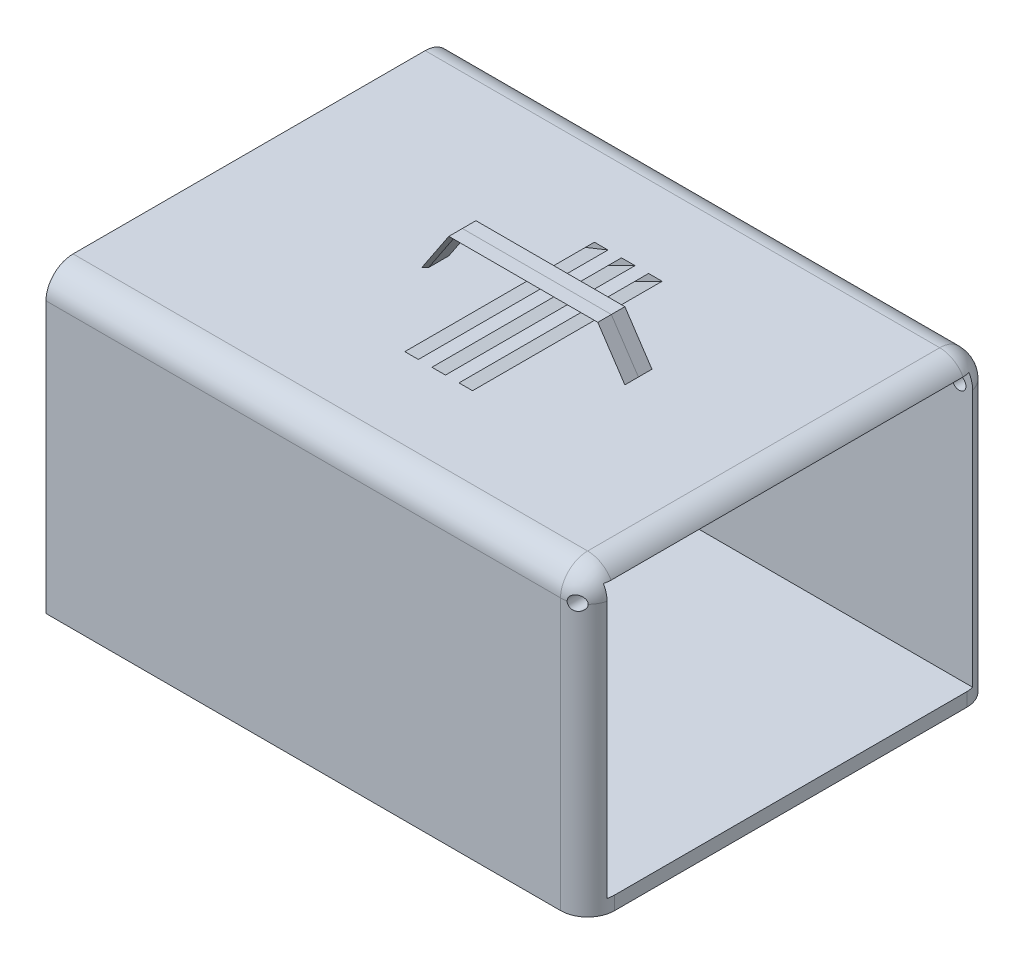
ISO-10303-21;
HEADER;
FILE_DESCRIPTION(('STEP AP214'),'2;1');
FILE_NAME('part.step','',(''),(''),'','','');
FILE_SCHEMA(('AUTOMOTIVE_DESIGN { 1 0 10303 214 1 1 1 1 }'));
ENDSEC;
DATA;
#1=APPLICATION_CONTEXT('core data for automotive mechanical design processes');
#2=APPLICATION_PROTOCOL_DEFINITION('international standard','automotive_design',2000,#1);
#3=PRODUCT_CONTEXT('',#1,'mechanical');
#4=PRODUCT('Part','Part','',(#3));
#5=PRODUCT_RELATED_PRODUCT_CATEGORY('part','',(#4));
#6=PRODUCT_DEFINITION_FORMATION('','',#4);
#7=PRODUCT_DEFINITION_CONTEXT('part definition',#1,'design');
#8=PRODUCT_DEFINITION('design','',#6,#7);
#9=PRODUCT_DEFINITION_SHAPE('','',#8);
#10=(LENGTH_UNIT() NAMED_UNIT(*) SI_UNIT(.MILLI.,.METRE.));
#11=(NAMED_UNIT(*) PLANE_ANGLE_UNIT() SI_UNIT($,.RADIAN.));
#12=(NAMED_UNIT(*) SI_UNIT($,.STERADIAN.) SOLID_ANGLE_UNIT());
#13=UNCERTAINTY_MEASURE_WITH_UNIT(LENGTH_MEASURE(1.E-05),#10,'distance_accuracy_value','');
#14=(GEOMETRIC_REPRESENTATION_CONTEXT(3) GLOBAL_UNCERTAINTY_ASSIGNED_CONTEXT((#13)) GLOBAL_UNIT_ASSIGNED_CONTEXT((#10,
#11,#12)) REPRESENTATION_CONTEXT('',''));
#15=CARTESIAN_POINT('',(0.,0.,0.));
#16=DIRECTION('',(0.,0.,1.));
#17=DIRECTION('',(1.,0.,0.));
#18=AXIS2_PLACEMENT_3D('',#15,#16,#17);
#19=CARTESIAN_POINT('',(400.,220.,300.));
#20=DIRECTION('',(0.,-1.,0.));
#21=DIRECTION('',(1.,0.,0.));
#22=AXIS2_PLACEMENT_3D('',#19,#20,#21);
#23=PLANE('',#22);
#24=DIRECTION('',(0.,0.,-1.));
#25=VECTOR('',#24,1.);
#26=CARTESIAN_POINT('',(285.,220.,300.));
#27=LINE('',#26,#25);
#28=CARTESIAN_POINT('',(285.,220.,157.5));
#29=VERTEX_POINT('',#28);
#30=CARTESIAN_POINT('',(285.,220.,142.5));
#31=VERTEX_POINT('',#30);
#32=EDGE_CURVE('E1230',#29,#31,#27,.T.);
#33=ORIENTED_EDGE('',*,*,#32,.T.);
#34=DIRECTION('',(0.707106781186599,0.,-0.707106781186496));
#35=VECTOR('',#34,1.);
#36=CARTESIAN_POINT('',(263.750000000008,220.,163.749999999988));
#37=LINE('',#36,#35);
#38=CARTESIAN_POINT('',(287.5,220.,140.));
#39=VERTEX_POINT('',#38);
#40=EDGE_CURVE('E12',#31,#39,#37,.T.);
#41=ORIENTED_EDGE('',*,*,#40,.T.);
#42=DIRECTION('',(0.,0.,1.));
#43=VECTOR('',#42,1.);
#44=CARTESIAN_POINT('',(287.5,220.,140.));
#45=LINE('',#44,#43);
#46=CARTESIAN_POINT('',(287.5,220.,150.));
#47=VERTEX_POINT('',#46);
#48=EDGE_CURVE('E465',#39,#47,#45,.T.);
#49=ORIENTED_EDGE('',*,*,#48,.T.);
#50=DIRECTION('',(0.,0.,1.));
#51=VECTOR('',#50,1.);
#52=CARTESIAN_POINT('',(287.5,220.,150.));
#53=LINE('',#52,#51);
#54=CARTESIAN_POINT('',(287.5,220.,160.));
#55=VERTEX_POINT('',#54);
#56=EDGE_CURVE('E461',#47,#55,#53,.T.);
#57=ORIENTED_EDGE('',*,*,#56,.T.);
#58=DIRECTION('',(-0.707106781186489,0.,-0.707106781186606));
#59=VECTOR('',#58,1.);
#60=CARTESIAN_POINT('',(413.74999999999,220.,286.250000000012));
#61=LINE('',#60,#59);
#62=EDGE_CURVE('E76',#55,#29,#61,.T.);
#63=ORIENTED_EDGE('',*,*,#62,.T.);
#64=EDGE_LOOP('',(#33,#41,#49,#57,#63));
#65=FACE_BOUND('',#64,.T.);
#66=DIRECTION('',(0.,0.,1.));
#67=VECTOR('',#66,1.);
#68=CARTESIAN_POINT('',(137.5,220.,150.));
#69=LINE('',#68,#67);
#70=CARTESIAN_POINT('',(137.5,220.,150.));
#71=VERTEX_POINT('',#70);
#72=CARTESIAN_POINT('',(137.5,220.,160.));
#73=VERTEX_POINT('',#72);
#74=EDGE_CURVE('E1284',#71,#73,#69,.T.);
#75=ORIENTED_EDGE('',*,*,#74,.F.);
#76=DIRECTION('',(0.,0.,1.));
#77=VECTOR('',#76,1.);
#78=CARTESIAN_POINT('',(137.5,220.,140.));
#79=LINE('',#78,#77);
#80=CARTESIAN_POINT('',(137.5,220.,140.));
#81=VERTEX_POINT('',#80);
#82=EDGE_CURVE('E1281',#81,#71,#79,.T.);
#83=ORIENTED_EDGE('',*,*,#82,.F.);
#84=DIRECTION('',(-0.707106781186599,0.,-0.707106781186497));
#85=VECTOR('',#84,1.);
#86=CARTESIAN_POINT('',(137.5,220.,140.));
#87=LINE('',#86,#85);
#88=CARTESIAN_POINT('',(140.,220.,142.5));
#89=VERTEX_POINT('',#88);
#90=EDGE_CURVE('E547',#89,#81,#87,.T.);
#91=ORIENTED_EDGE('',*,*,#90,.F.);
#92=DIRECTION('',(0.,0.,-1.));
#93=VECTOR('',#92,1.);
#94=CARTESIAN_POINT('',(140.,220.,142.5));
#95=LINE('',#94,#93);
#96=CARTESIAN_POINT('',(140.,220.,157.5));
#97=VERTEX_POINT('',#96);
#98=EDGE_CURVE('E433',#97,#89,#95,.T.);
#99=ORIENTED_EDGE('',*,*,#98,.F.);
#100=DIRECTION('',(0.707106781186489,0.,-0.707106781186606));
#101=VECTOR('',#100,1.);
#102=CARTESIAN_POINT('',(140.,220.,157.5));
#103=LINE('',#102,#101);
#104=EDGE_CURVE('E419',#73,#97,#103,.T.);
#105=ORIENTED_EDGE('',*,*,#104,.F.);
#106=EDGE_LOOP('',(#75,#83,#91,#99,#105));
#107=FACE_BOUND('',#106,.T.);
#108=DIRECTION('',(1.,0.,0.));
#109=VECTOR('',#108,1.);
#110=CARTESIAN_POINT('',(205.,220.,220.));
#111=LINE('',#110,#109);
#112=CARTESIAN_POINT('',(205.,220.,220.));
#113=VERTEX_POINT('',#112);
#114=CARTESIAN_POINT('',(215.,220.,220.));
#115=VERTEX_POINT('',#114);
#116=EDGE_CURVE('E656',#113,#115,#111,.T.);
#117=ORIENTED_EDGE('',*,*,#116,.F.);
#118=DIRECTION('',(0.,0.,1.));
#119=VECTOR('',#118,1.);
#120=CARTESIAN_POINT('',(205.,220.,80.));
#121=LINE('',#120,#119);
#122=CARTESIAN_POINT('',(205.,220.,80.));
#123=VERTEX_POINT('',#122);
#124=EDGE_CURVE('E651',#123,#113,#121,.T.);
#125=ORIENTED_EDGE('',*,*,#124,.F.);
#126=DIRECTION('',(-1.,0.,0.));
#127=VECTOR('',#126,1.);
#128=CARTESIAN_POINT('',(205.,220.,80.));
#129=LINE('',#128,#127);
#130=CARTESIAN_POINT('',(215.,220.,80.));
#131=VERTEX_POINT('',#130);
#132=EDGE_CURVE('E644',#131,#123,#129,.T.);
#133=ORIENTED_EDGE('',*,*,#132,.F.);
#134=DIRECTION('',(0.,0.,-1.));
#135=VECTOR('',#134,1.);
#136=CARTESIAN_POINT('',(215.,220.,80.));
#137=LINE('',#136,#135);
#138=EDGE_CURVE('E648',#115,#131,#137,.T.);
#139=ORIENTED_EDGE('',*,*,#138,.F.);
#140=EDGE_LOOP('',(#117,#125,#133,#139));
#141=FACE_BOUND('',#140,.T.);
#142=DIRECTION('',(0.,0.,1.));
#143=VECTOR('',#142,1.);
#144=CARTESIAN_POINT('',(185.,220.,80.));
#145=LINE('',#144,#143);
#146=CARTESIAN_POINT('',(185.,220.,80.));
#147=VERTEX_POINT('',#146);
#148=CARTESIAN_POINT('',(185.,220.,220.));
#149=VERTEX_POINT('',#148);
#150=EDGE_CURVE('E679',#147,#149,#145,.T.);
#151=ORIENTED_EDGE('',*,*,#150,.F.);
#152=DIRECTION('',(-1.,0.,0.));
#153=VECTOR('',#152,1.);
#154=CARTESIAN_POINT('',(195.,220.,80.));
#155=LINE('',#154,#153);
#156=CARTESIAN_POINT('',(195.,220.,80.));
#157=VERTEX_POINT('',#156);
#158=EDGE_CURVE('E733',#157,#147,#155,.T.);
#159=ORIENTED_EDGE('',*,*,#158,.F.);
#160=DIRECTION('',(0.,0.,-1.));
#161=VECTOR('',#160,1.);
#162=CARTESIAN_POINT('',(195.,220.,220.));
#163=LINE('',#162,#161);
#164=CARTESIAN_POINT('',(195.,220.,220.));
#165=VERTEX_POINT('',#164);
#166=EDGE_CURVE('E647',#165,#157,#163,.T.);
#167=ORIENTED_EDGE('',*,*,#166,.F.);
#168=DIRECTION('',(1.,0.,0.));
#169=VECTOR('',#168,1.);
#170=CARTESIAN_POINT('',(185.,220.,220.));
#171=LINE('',#170,#169);
#172=EDGE_CURVE('E732',#149,#165,#171,.T.);
#173=ORIENTED_EDGE('',*,*,#172,.F.);
#174=EDGE_LOOP('',(#151,#159,#167,#173));
#175=FACE_BOUND('',#174,.T.);
#176=DIRECTION('',(-1.,0.,0.));
#177=VECTOR('',#176,1.);
#178=CARTESIAN_POINT('',(400.,220.,280.));
#179=LINE('',#178,#177);
#180=CARTESIAN_POINT('',(0.,220.,280.));
#181=VERTEX_POINT('',#180);
#182=CARTESIAN_POINT('',(380.,220.,280.));
#183=VERTEX_POINT('',#182);
#184=EDGE_CURVE('E1137',#181,#183,#179,.F.);
#185=ORIENTED_EDGE('',*,*,#184,.T.);
#186=DIRECTION('',(0.,0.,-1.));
#187=VECTOR('',#186,1.);
#188=CARTESIAN_POINT('',(380.,220.,300.));
#189=LINE('',#188,#187);
#190=CARTESIAN_POINT('',(380.,220.,20.));
#191=VERTEX_POINT('',#190);
#192=EDGE_CURVE('E1192',#183,#191,#189,.T.);
#193=ORIENTED_EDGE('',*,*,#192,.T.);
#194=DIRECTION('',(-1.,0.,0.));
#195=VECTOR('',#194,1.);
#196=CARTESIAN_POINT('',(400.,220.,20.));
#197=LINE('',#196,#195);
#198=CARTESIAN_POINT('',(0.,220.,20.));
#199=VERTEX_POINT('',#198);
#200=EDGE_CURVE('E1141',#191,#199,#197,.T.);
#201=ORIENTED_EDGE('',*,*,#200,.T.);
#202=DIRECTION('',(0.,0.,-1.));
#203=VECTOR('',#202,1.);
#204=CARTESIAN_POINT('',(0.,220.,300.));
#205=LINE('',#204,#203);
#206=EDGE_CURVE('E1125',#181,#199,#205,.T.);
#207=ORIENTED_EDGE('',*,*,#206,.F.);
#208=EDGE_LOOP('',(#185,#193,#201,#207));
#209=FACE_BOUND('',#208,.T.);
#210=DIRECTION('',(1.,0.,0.));
#211=VECTOR('',#210,1.);
#212=CARTESIAN_POINT('',(225.,220.,220.));
#213=LINE('',#212,#211);
#214=CARTESIAN_POINT('',(225.,220.,220.));
#215=VERTEX_POINT('',#214);
#216=CARTESIAN_POINT('',(235.,220.,220.));
#217=VERTEX_POINT('',#216);
#218=EDGE_CURVE('E570',#215,#217,#213,.T.);
#219=ORIENTED_EDGE('',*,*,#218,.F.);
#220=DIRECTION('',(0.,0.,1.));
#221=VECTOR('',#220,1.);
#222=CARTESIAN_POINT('',(225.,220.,80.));
#223=LINE('',#222,#221);
#224=CARTESIAN_POINT('',(225.,220.,80.));
#225=VERTEX_POINT('',#224);
#226=EDGE_CURVE('E565',#225,#215,#223,.T.);
#227=ORIENTED_EDGE('',*,*,#226,.F.);
#228=DIRECTION('',(-1.,0.,0.));
#229=VECTOR('',#228,1.);
#230=CARTESIAN_POINT('',(225.,220.,80.));
#231=LINE('',#230,#229);
#232=CARTESIAN_POINT('',(235.,220.,80.));
#233=VERTEX_POINT('',#232);
#234=EDGE_CURVE('E558',#233,#225,#231,.T.);
#235=ORIENTED_EDGE('',*,*,#234,.F.);
#236=DIRECTION('',(0.,0.,-1.));
#237=VECTOR('',#236,1.);
#238=CARTESIAN_POINT('',(235.,220.,80.));
#239=LINE('',#238,#237);
#240=EDGE_CURVE('E562',#217,#233,#239,.T.);
#241=ORIENTED_EDGE('',*,*,#240,.F.);
#242=EDGE_LOOP('',(#219,#227,#235,#241));
#243=FACE_BOUND('',#242,.T.);
#244=ADVANCED_FACE('F67',(#65,#107,#141,#175,#209,#243),#23,.F.);
#245=CARTESIAN_POINT('',(10.,210.,285.));
#246=DIRECTION('',(0.,1.,0.));
#247=DIRECTION('',(0.,0.,1.));
#248=AXIS2_PLACEMENT_3D('',#245,#246,#247);
#249=PLANE('',#248);
#250=DIRECTION('',(-1.,0.,0.));
#251=VECTOR('',#250,1.);
#252=CARTESIAN_POINT('',(195.,210.,220.));
#253=LINE('',#252,#251);
#254=CARTESIAN_POINT('',(195.,210.,220.));
#255=VERTEX_POINT('',#254);
#256=CARTESIAN_POINT('',(185.,210.,220.));
#257=VERTEX_POINT('',#256);
#258=EDGE_CURVE('E580',#255,#257,#253,.T.);
#259=ORIENTED_EDGE('',*,*,#258,.F.);
#260=DIRECTION('',(0.,0.,1.));
#261=VECTOR('',#260,1.);
#262=CARTESIAN_POINT('',(195.,210.,220.));
#263=LINE('',#262,#261);
#264=CARTESIAN_POINT('',(195.,210.,80.));
#265=VERTEX_POINT('',#264);
#266=EDGE_CURVE('E561',#265,#255,#263,.T.);
#267=ORIENTED_EDGE('',*,*,#266,.F.);
#268=DIRECTION('',(1.,0.,0.));
#269=VECTOR('',#268,1.);
#270=CARTESIAN_POINT('',(195.,210.,80.));
#271=LINE('',#270,#269);
#272=CARTESIAN_POINT('',(185.,210.,80.));
#273=VERTEX_POINT('',#272);
#274=EDGE_CURVE('E633',#273,#265,#271,.T.);
#275=ORIENTED_EDGE('',*,*,#274,.F.);
#276=DIRECTION('',(0.,0.,-1.));
#277=VECTOR('',#276,1.);
#278=CARTESIAN_POINT('',(185.,210.,220.));
#279=LINE('',#278,#277);
#280=EDGE_CURVE('E638',#257,#273,#279,.T.);
#281=ORIENTED_EDGE('',*,*,#280,.F.);
#282=EDGE_LOOP('',(#259,#267,#275,#281));
#283=FACE_BOUND('',#282,.T.);
#284=DIRECTION('',(0.,0.,-1.));
#285=VECTOR('',#284,1.);
#286=CARTESIAN_POINT('',(170.,210.,220.));
#287=LINE('',#286,#285);
#288=CARTESIAN_POINT('',(170.,210.,220.));
#289=VERTEX_POINT('',#288);
#290=CARTESIAN_POINT('',(170.,210.,80.));
#291=VERTEX_POINT('',#290);
#292=EDGE_CURVE('E666',#289,#291,#287,.T.);
#293=ORIENTED_EDGE('',*,*,#292,.T.);
#294=DIRECTION('',(-1.,0.,0.));
#295=VECTOR('',#294,1.);
#296=CARTESIAN_POINT('',(170.,210.,80.));
#297=LINE('',#296,#295);
#298=CARTESIAN_POINT('',(160.,210.,80.));
#299=VERTEX_POINT('',#298);
#300=EDGE_CURVE('E903',#291,#299,#297,.T.);
#301=ORIENTED_EDGE('',*,*,#300,.T.);
#302=DIRECTION('',(0.,0.,-1.));
#303=VECTOR('',#302,1.);
#304=CARTESIAN_POINT('',(160.,210.,220.));
#305=LINE('',#304,#303);
#306=CARTESIAN_POINT('',(160.,210.,220.));
#307=VERTEX_POINT('',#306);
#308=EDGE_CURVE('E907',#307,#299,#305,.T.);
#309=ORIENTED_EDGE('',*,*,#308,.F.);
#310=DIRECTION('',(1.,0.,0.));
#311=VECTOR('',#310,1.);
#312=CARTESIAN_POINT('',(160.,210.,220.));
#313=LINE('',#312,#311);
#314=EDGE_CURVE('E910',#307,#289,#313,.T.);
#315=ORIENTED_EDGE('',*,*,#314,.T.);
#316=EDGE_LOOP('',(#293,#301,#309,#315));
#317=FACE_BOUND('',#316,.T.);
#318=DIRECTION('',(1.,0.,0.));
#319=VECTOR('',#318,1.);
#320=CARTESIAN_POINT('',(10.,210.,15.));
#321=LINE('',#320,#319);
#322=CARTESIAN_POINT('',(10.,210.,15.));
#323=VERTEX_POINT('',#322);
#324=CARTESIAN_POINT('',(396.583123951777,210.,15.));
#325=VERTEX_POINT('',#324);
#326=EDGE_CURVE('E1095',#323,#325,#321,.T.);
#327=ORIENTED_EDGE('',*,*,#326,.T.);
#328=CARTESIAN_POINT('',(380.,210.,20.));
#329=DIRECTION('',(0.,1.,0.));
#330=DIRECTION('',(0.,0.,1.));
#331=AXIS2_PLACEMENT_3D('',#328,#329,#330);
#332=CIRCLE('',#331,17.3205080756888);
#333=CARTESIAN_POINT('',(397.320508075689,210.,20.));
#334=VERTEX_POINT('',#333);
#335=EDGE_CURVE('E1204',#325,#334,#332,.F.);
#336=ORIENTED_EDGE('',*,*,#335,.T.);
#337=DIRECTION('',(0.,0.,-1.));
#338=VECTOR('',#337,1.);
#339=CARTESIAN_POINT('',(397.320508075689,210.,300.));
#340=LINE('',#339,#338);
#341=CARTESIAN_POINT('',(397.320508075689,210.,280.));
#342=VERTEX_POINT('',#341);
#343=EDGE_CURVE('E1201',#334,#342,#340,.F.);
#344=ORIENTED_EDGE('',*,*,#343,.T.);
#345=CARTESIAN_POINT('',(380.,210.,280.));
#346=DIRECTION('',(0.,1.,0.));
#347=DIRECTION('',(0.,0.,1.));
#348=AXIS2_PLACEMENT_3D('',#345,#346,#347);
#349=CIRCLE('',#348,17.3205080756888);
#350=CARTESIAN_POINT('',(396.583123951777,210.,285.));
#351=VERTEX_POINT('',#350);
#352=EDGE_CURVE('E1198',#342,#351,#349,.F.);
#353=ORIENTED_EDGE('',*,*,#352,.T.);
#354=DIRECTION('',(1.,0.,0.));
#355=VECTOR('',#354,1.);
#356=CARTESIAN_POINT('',(10.,210.,285.));
#357=LINE('',#356,#355);
#358=CARTESIAN_POINT('',(10.,210.,285.));
#359=VERTEX_POINT('',#358);
#360=EDGE_CURVE('E1099',#359,#351,#357,.T.);
#361=ORIENTED_EDGE('',*,*,#360,.F.);
#362=DIRECTION('',(0.,0.,1.));
#363=VECTOR('',#362,1.);
#364=CARTESIAN_POINT('',(10.,210.,285.));
#365=LINE('',#364,#363);
#366=EDGE_CURVE('E1083',#323,#359,#365,.T.);
#367=ORIENTED_EDGE('',*,*,#366,.F.);
#368=EDGE_LOOP('',(#327,#336,#344,#353,#361,#367));
#369=FACE_BOUND('',#368,.T.);
#370=DIRECTION('',(-1.,0.,0.));
#371=VECTOR('',#370,1.);
#372=CARTESIAN_POINT('',(215.,210.,220.));
#373=LINE('',#372,#371);
#374=CARTESIAN_POINT('',(215.,210.,220.));
#375=VERTEX_POINT('',#374);
#376=CARTESIAN_POINT('',(205.,210.,220.));
#377=VERTEX_POINT('',#376);
#378=EDGE_CURVE('E491',#375,#377,#373,.T.);
#379=ORIENTED_EDGE('',*,*,#378,.F.);
#380=DIRECTION('',(0.,0.,1.));
#381=VECTOR('',#380,1.);
#382=CARTESIAN_POINT('',(215.,210.,220.));
#383=LINE('',#382,#381);
#384=CARTESIAN_POINT('',(215.,210.,80.));
#385=VERTEX_POINT('',#384);
#386=EDGE_CURVE('E504',#385,#375,#383,.T.);
#387=ORIENTED_EDGE('',*,*,#386,.F.);
#388=DIRECTION('',(1.,0.,0.));
#389=VECTOR('',#388,1.);
#390=CARTESIAN_POINT('',(215.,210.,80.));
#391=LINE('',#390,#389);
#392=CARTESIAN_POINT('',(205.,210.,80.));
#393=VERTEX_POINT('',#392);
#394=EDGE_CURVE('E546',#393,#385,#391,.T.);
#395=ORIENTED_EDGE('',*,*,#394,.F.);
#396=DIRECTION('',(0.,0.,-1.));
#397=VECTOR('',#396,1.);
#398=CARTESIAN_POINT('',(205.,210.,220.));
#399=LINE('',#398,#397);
#400=EDGE_CURVE('E552',#377,#393,#399,.T.);
#401=ORIENTED_EDGE('',*,*,#400,.F.);
#402=EDGE_LOOP('',(#379,#387,#395,#401));
#403=FACE_BOUND('',#402,.T.);
#404=ADVANCED_FACE('F745',(#283,#317,#369,#403),#249,.F.);
#405=CARTESIAN_POINT('',(380.,200.,20.));
#406=DIRECTION('',(-1.,0.,0.));
#407=DIRECTION('',(0.,0.,1.));
#408=AXIS2_PLACEMENT_3D('',#405,#406,#407);
#409=SPHERICAL_SURFACE('',#408,20.);
#410=CARTESIAN_POINT('',(380.,200.,20.));
#411=DIRECTION('',(0.,-1.,0.));
#412=DIRECTION('',(0.,0.,-1.));
#413=AXIS2_PLACEMENT_3D('',#410,#411,#412);
#414=CIRCLE('',#413,20.);
#415=CARTESIAN_POINT('',(394.364916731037,200.,6.08421158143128));
#416=VERTEX_POINT('',#415);
#417=CARTESIAN_POINT('',(399.364916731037,200.,15.));
#418=VERTEX_POINT('',#417);
#419=EDGE_CURVE('E1055',#416,#418,#414,.T.);
#420=ORIENTED_EDGE('',*,*,#419,.F.);
#421=CARTESIAN_POINT('',(384.364916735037,199.9998,0.482123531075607));
#422=CARTESIAN_POINT('',(384.364890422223,200.130174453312,0.482112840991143));
#423=CARTESIAN_POINT('',(384.37000461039,200.260542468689,0.484564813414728));
#424=CARTESIAN_POINT('',(384.390359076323,200.520272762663,0.494333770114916));
#425=CARTESIAN_POINT('',(384.405597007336,200.649635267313,0.501649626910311));
#426=CARTESIAN_POINT('',(384.445980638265,200.906019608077,0.521055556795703));
#427=CARTESIAN_POINT('',(384.471095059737,201.033047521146,0.533130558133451));
#428=CARTESIAN_POINT('',(384.530942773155,201.284276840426,0.56194272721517));
#429=CARTESIAN_POINT('',(384.565676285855,201.408478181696,0.57868000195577));
#430=CARTESIAN_POINT('',(384.644357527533,201.653125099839,0.616657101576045));
#431=CARTESIAN_POINT('',(384.688299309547,201.773573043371,0.637894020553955));
#432=CARTESIAN_POINT('',(384.784965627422,202.010067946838,0.684705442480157));
#433=CARTESIAN_POINT('',(384.837693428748,202.126113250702,0.7102815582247));
#434=CARTESIAN_POINT('',(384.951393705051,202.353066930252,0.765560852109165));
#435=CARTESIAN_POINT('',(385.012366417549,202.463975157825,0.795264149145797));
#436=CARTESIAN_POINT('',(385.141998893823,202.680084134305,0.858581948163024));
#437=CARTESIAN_POINT('',(385.210661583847,202.785282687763,0.892197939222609));
#438=CARTESIAN_POINT('',(385.357649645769,202.993088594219,0.964372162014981));
#439=CARTESIAN_POINT('',(385.436233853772,203.09546639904,1.00306473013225));
#440=CARTESIAN_POINT('',(385.600282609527,203.293029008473,1.08410853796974));
#441=CARTESIAN_POINT('',(385.685749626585,203.388211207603,1.12646109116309));
#442=CARTESIAN_POINT('',(385.951397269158,203.662311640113,1.25858263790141));
#443=CARTESIAN_POINT('',(386.140916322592,203.829912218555,1.35346044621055));
#444=CARTESIAN_POINT('',(386.557396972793,204.146384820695,1.56376512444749));
#445=CARTESIAN_POINT('',(386.786200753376,204.292083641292,1.68028139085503));
#446=CARTESIAN_POINT('',(387.259708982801,204.543121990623,1.92395565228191));
#447=CARTESIAN_POINT('',(387.504419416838,204.648446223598,2.05111765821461));
#448=CARTESIAN_POINT('',(388.030140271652,204.827365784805,2.32743629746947));
#449=CARTESIAN_POINT('',(388.312238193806,204.89637753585,2.47749212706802));
#450=CARTESIAN_POINT('',(388.880702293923,204.984814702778,2.78398692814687));
#451=CARTESIAN_POINT('',(389.167070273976,205.004218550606,2.94042864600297));
#452=CARTESIAN_POINT('',(389.763163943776,204.99380640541,3.27071832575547));
#453=CARTESIAN_POINT('',(390.07265359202,204.959368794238,3.44485853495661));
#454=CARTESIAN_POINT('',(390.680566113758,204.833787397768,3.79238877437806));
#455=CARTESIAN_POINT('',(390.978982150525,204.742609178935,3.96577828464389));
#456=CARTESIAN_POINT('',(391.566972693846,204.500623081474,4.31289234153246));
#457=CARTESIAN_POINT('',(391.855846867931,204.347794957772,4.48640612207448));
#458=CARTESIAN_POINT('',(392.403212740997,203.984531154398,4.82042902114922));
#459=CARTESIAN_POINT('',(392.661736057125,203.774156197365,4.9809516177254));
#460=CARTESIAN_POINT('',(393.085691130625,203.35036525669,5.24796105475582));
#461=CARTESIAN_POINT('',(393.259129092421,203.147618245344,5.35859763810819));
#462=CARTESIAN_POINT('',(393.495762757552,202.820334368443,5.51100829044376));
#463=CARTESIAN_POINT('',(393.570747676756,202.707324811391,5.55957270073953));
#464=CARTESIAN_POINT('',(393.712062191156,202.474045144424,5.6515111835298));
#465=CARTESIAN_POINT('',(393.778395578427,202.353778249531,5.6948875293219));
#466=CARTESIAN_POINT('',(393.902143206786,202.105467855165,5.77612898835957));
#467=CARTESIAN_POINT('',(393.959471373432,201.977363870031,5.81394072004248));
#468=CARTESIAN_POINT('',(394.06360649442,201.715278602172,5.8828527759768));
#469=CARTESIAN_POINT('',(394.110419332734,201.581300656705,5.91395685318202));
#470=CARTESIAN_POINT('',(394.192703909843,201.308703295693,5.9687692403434));
#471=CARTESIAN_POINT('',(394.228196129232,201.17009276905,5.99249090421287));
#472=CARTESIAN_POINT('',(394.287278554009,200.889330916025,6.03204703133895));
#473=CARTESIAN_POINT('',(394.310877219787,200.74718218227,6.0478871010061));
#474=CARTESIAN_POINT('',(394.340479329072,200.503923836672,6.06777320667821));
#475=CARTESIAN_POINT('',(394.349642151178,200.403357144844,6.07393497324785));
#476=CARTESIAN_POINT('',(394.361863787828,200.201799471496,6.08215703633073));
#477=CARTESIAN_POINT('',(394.364929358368,200.100809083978,6.08422187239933));
#478=CARTESIAN_POINT('',(394.364916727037,199.9998,6.0842115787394));
#479=B_SPLINE_CURVE_WITH_KNOTS('',3,(#421,#422,#423,#424,#425,#426,#427,#428,#429,#430,#431,
#432,#433,#434,#435,#436,#437,#438,#439,#440,#441,#442,#443,#444,#445,#446,#447,#448,#449,#450,
#451,#452,#453,#454,#455,#456,#457,#458,#459,#460,#461,#462,#463,#464,#465,#466,#467,#468,#469,
#470,#471,#472,#473,#474,#475,#476,#477,#478),.UNSPECIFIED.,.F.,.F.,(4,2,2,2,2,2,2,2,2,2,2,2,2,
2,2,2,2,2,2,2,2,2,2,2,2,2,2,2,4),(0.,0.390989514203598,0.781888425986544,1.17155921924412,
1.56123895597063,1.95066779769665,2.34024170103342,2.7298268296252,3.11956071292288,
3.5233222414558,3.92722927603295,4.73455602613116,5.61667049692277,6.49911882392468,
7.47570807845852,8.4527218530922,9.51830915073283,10.5845437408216,11.6889969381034,
12.7922891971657,13.6549686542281,14.0866852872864,14.5182120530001,14.9536408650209,
15.388825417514,15.8232181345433,16.2573014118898,16.5605613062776,16.863484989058),.UNSPECIFIED.);
#480=CARTESIAN_POINT('',(384.364916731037,200.,0.482123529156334));
#481=VERTEX_POINT('',#480);
#482=EDGE_CURVE('E920',#481,#416,#479,.T.);
#483=ORIENTED_EDGE('',*,*,#482,.F.);
#484=CARTESIAN_POINT('',(380.,200.,0.));
#485=VERTEX_POINT('',#484);
#486=EDGE_CURVE('E1058',#485,#481,#414,.T.);
#487=ORIENTED_EDGE('',*,*,#486,.F.);
#488=CARTESIAN_POINT('',(380.,200.,20.));
#489=DIRECTION('',(-1.,0.,0.));
#490=DIRECTION('',(0.,-1.,0.));
#491=AXIS2_PLACEMENT_3D('',#488,#489,#490);
#492=CIRCLE('',#491,20.);
#493=EDGE_CURVE('E1195',#191,#485,#492,.T.);
#494=ORIENTED_EDGE('',*,*,#493,.F.);
#495=CARTESIAN_POINT('',(380.,200.,20.));
#496=DIRECTION('',(0.,0.,-1.));
#497=DIRECTION('',(-1.,0.,0.));
#498=AXIS2_PLACEMENT_3D('',#495,#496,#497);
#499=CIRCLE('',#498,20.);
#500=EDGE_CURVE('E1062',#191,#334,#499,.T.);
#501=ORIENTED_EDGE('',*,*,#500,.T.);
#502=ORIENTED_EDGE('',*,*,#335,.F.);
#503=CARTESIAN_POINT('',(380.,200.,15.));
#504=DIRECTION('',(0.,0.,-1.));
#505=DIRECTION('',(-1.,0.,0.));
#506=AXIS2_PLACEMENT_3D('',#503,#504,#505);
#507=CIRCLE('',#506,19.3649167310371);
#508=EDGE_CURVE('E1170',#418,#325,#507,.F.);
#509=ORIENTED_EDGE('',*,*,#508,.F.);
#510=EDGE_LOOP('',(#420,#483,#487,#494,#501,#502,#509));
#511=FACE_BOUND('',#510,.T.);
#512=ADVANCED_FACE('F755',(#511),#409,.T.);
#513=CARTESIAN_POINT('',(380.,0.,20.));
#514=DIRECTION('',(0.,1.,0.));
#515=DIRECTION('',(0.,0.,1.));
#516=AXIS2_PLACEMENT_3D('',#513,#514,#515);
#517=CYLINDRICAL_SURFACE('',#516,20.);
#518=ORIENTED_EDGE('',*,*,#486,.T.);
#519=CARTESIAN_POINT('',(394.364916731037,200.,6.0842115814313));
#520=CARTESIAN_POINT('',(394.364947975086,199.885521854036,6.08425758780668));
#521=CARTESIAN_POINT('',(394.360986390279,199.771075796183,6.08015462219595));
#522=CARTESIAN_POINT('',(394.345322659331,199.543406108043,6.06400540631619));
#523=CARTESIAN_POINT('',(394.333629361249,199.430181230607,6.05196823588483));
#524=CARTESIAN_POINT('',(394.302911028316,199.207042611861,6.02047270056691));
#525=CARTESIAN_POINT('',(394.283965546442,199.097106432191,6.00109488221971));
#526=CARTESIAN_POINT('',(394.239148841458,198.880111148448,5.95551114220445));
#527=CARTESIAN_POINT('',(394.213276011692,198.773052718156,5.9293036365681));
#528=CARTESIAN_POINT('',(394.126210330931,198.458160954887,5.8417187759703));
#529=CARTESIAN_POINT('',(394.055398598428,198.25541835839,5.77119871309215));
#530=CARTESIAN_POINT('',(393.89183006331,197.866485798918,5.61145671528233));
#531=CARTESIAN_POINT('',(393.799001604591,197.680352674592,5.52217382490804));
#532=CARTESIAN_POINT('',(393.546100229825,197.241597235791,5.28451154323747));
#533=CARTESIAN_POINT('',(393.37505038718,196.999492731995,5.12823002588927));
#534=CARTESIAN_POINT('',(393.09427831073,196.666380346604,4.88194407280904));
#535=CARTESIAN_POINT('',(392.996547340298,196.560261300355,4.79778339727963));
#536=CARTESIAN_POINT('',(392.793608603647,196.357941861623,4.62660775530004));
#537=CARTESIAN_POINT('',(392.688401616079,196.26174043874,4.53959308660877));
#538=CARTESIAN_POINT('',(392.357582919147,195.984023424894,4.27195406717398));
#539=CARTESIAN_POINT('',(392.120846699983,195.818187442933,4.08836100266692));
#540=CARTESIAN_POINT('',(391.747566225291,195.601855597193,3.81300467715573));
#541=CARTESIAN_POINT('',(391.620068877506,195.535133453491,3.72119711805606));
#542=CARTESIAN_POINT('',(391.359352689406,195.412739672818,3.53821363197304));
#543=CARTESIAN_POINT('',(391.226133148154,195.357069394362,3.44703778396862));
#544=CARTESIAN_POINT('',(390.933813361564,195.249591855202,3.25225062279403));
#545=CARTESIAN_POINT('',(390.773866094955,195.199670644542,3.14886497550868));
#546=CARTESIAN_POINT('',(390.448110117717,195.115845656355,2.94497443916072));
#547=CARTESIAN_POINT('',(390.282303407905,195.081936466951,2.84446858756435));
#548=CARTESIAN_POINT('',(389.945830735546,195.030945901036,2.64723401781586));
#549=CARTESIAN_POINT('',(389.775163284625,195.013869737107,2.5505064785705));
#550=CARTESIAN_POINT('',(389.430385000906,194.997451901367,2.36179033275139));
#551=CARTESIAN_POINT('',(389.256274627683,194.998107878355,2.26980109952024));
#552=CARTESIAN_POINT('',(388.918692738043,195.017290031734,2.09775926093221));
#553=CARTESIAN_POINT('',(388.755344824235,195.034542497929,2.01732297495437));
#554=CARTESIAN_POINT('',(388.428658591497,195.08565945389,1.86190700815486));
#555=CARTESIAN_POINT('',(388.265320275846,195.119521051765,1.78692638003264));
#556=CARTESIAN_POINT('',(387.940572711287,195.204233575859,1.64301711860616));
#557=CARTESIAN_POINT('',(387.779161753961,195.255068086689,1.57408271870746));
#558=CARTESIAN_POINT('',(387.46010384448,195.373916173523,1.44261315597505));
#559=CARTESIAN_POINT('',(387.302456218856,195.441926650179,1.380076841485));
#560=CARTESIAN_POINT('',(387.015096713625,195.584089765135,1.27011424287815));
#561=CARTESIAN_POINT('',(386.884603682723,195.655988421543,1.22180441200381));
#562=CARTESIAN_POINT('',(386.629330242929,195.812048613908,1.13017319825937));
#563=CARTESIAN_POINT('',(386.504549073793,195.89620851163,1.08685115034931));
#564=CARTESIAN_POINT('',(386.262129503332,196.076289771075,1.00520880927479));
#565=CARTESIAN_POINT('',(386.144487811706,196.172205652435,0.966886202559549));
#566=CARTESIAN_POINT('',(385.917623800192,196.375178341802,0.895134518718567));
#567=CARTESIAN_POINT('',(385.808400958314,196.482234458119,0.861705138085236));
#568=CARTESIAN_POINT('',(385.609366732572,196.69618970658,0.802480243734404));
#569=CARTESIAN_POINT('',(385.518694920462,196.802173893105,0.776263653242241));
#570=CARTESIAN_POINT('',(385.346165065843,197.021889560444,0.727570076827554));
#571=CARTESIAN_POINT('',(385.264306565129,197.135620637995,0.705092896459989));
#572=CARTESIAN_POINT('',(385.11015495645,197.370040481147,0.66369500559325));
#573=CARTESIAN_POINT('',(385.037864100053,197.490730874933,0.644775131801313));
#574=CARTESIAN_POINT('',(384.903544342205,197.738149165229,0.610310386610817));
#575=CARTESIAN_POINT('',(384.841515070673,197.864876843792,0.594765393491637));
#576=CARTESIAN_POINT('',(384.729919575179,198.11968450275,0.567268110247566));
#577=CARTESIAN_POINT('',(384.680045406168,198.247619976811,0.555225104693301));
#578=CARTESIAN_POINT('',(384.590934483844,198.507370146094,0.53399320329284));
#579=CARTESIAN_POINT('',(384.551697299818,198.639184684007,0.524804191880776));
#580=CARTESIAN_POINT('',(384.484239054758,198.905543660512,0.509161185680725));
#581=CARTESIAN_POINT('',(384.456001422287,199.04008366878,0.502703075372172));
#582=CARTESIAN_POINT('',(384.41070264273,199.311074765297,0.492405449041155));
#583=CARTESIAN_POINT('',(384.393635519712,199.447524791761,0.488564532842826));
#584=CARTESIAN_POINT('',(384.376448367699,199.653585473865,0.484705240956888));
#585=CARTESIAN_POINT('',(384.37212140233,199.722852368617,0.483735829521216));
#586=CARTESIAN_POINT('',(384.366357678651,199.861410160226,0.482445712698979));
#587=CARTESIAN_POINT('',(384.364916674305,199.930700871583,0.4821240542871));
#588=CARTESIAN_POINT('',(384.364916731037,200.,0.482123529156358));
#589=B_SPLINE_CURVE_WITH_KNOTS('',3,(#519,#520,#521,#522,#523,#524,#525,#526,#527,#528,#529,
#530,#531,#532,#533,#534,#535,#536,#537,#538,#539,#540,#541,#542,#543,#544,#545,#546,#547,#548,
#549,#550,#551,#552,#553,#554,#555,#556,#557,#558,#559,#560,#561,#562,#563,#564,#565,#566,#567,
#568,#569,#570,#571,#572,#573,#574,#575,#576,#577,#578,#579,#580,#581,#582,#583,#584,#585,#586,
#587,#588),.UNSPECIFIED.,.F.,.F.,(4,2,2,2,2,2,2,2,2,2,2,2,2,2,2,2,2,2,2,2,2,2,2,2,2,2,2,2,2,2,2,
2,2,2,4),(0.,0.343240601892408,0.686089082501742,1.02527972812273,1.36454911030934,
2.03948124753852,2.71664092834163,3.7160880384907,4.21679131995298,4.71744252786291,
5.74031488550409,6.25205960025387,6.76386718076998,7.35378084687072,7.94349498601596,
8.53339168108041,9.12321015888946,9.67109835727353,10.2188911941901,10.7661557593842,
11.3133216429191,11.7825660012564,12.251747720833,12.7207115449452,13.1896462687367,
13.6148842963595,14.0401002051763,14.4654160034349,14.8907164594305,15.303746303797,
15.7167594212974,16.1291478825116,16.5413155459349,16.7494869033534,16.9573517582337),.UNSPECIFIED.);
#590=EDGE_CURVE('E917',#416,#481,#589,.T.);
#591=ORIENTED_EDGE('',*,*,#590,.F.);
#592=ORIENTED_EDGE('',*,*,#419,.T.);
#593=DIRECTION('',(0.,1.,0.));
#594=VECTOR('',#593,1.);
#595=CARTESIAN_POINT('',(399.364916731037,0.,15.));
#596=LINE('',#595,#594);
#597=CARTESIAN_POINT('',(399.364916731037,10.,15.));
#598=VERTEX_POINT('',#597);
#599=EDGE_CURVE('E1173',#598,#418,#596,.T.);
#600=ORIENTED_EDGE('',*,*,#599,.F.);
#601=CARTESIAN_POINT('',(380.,10.,20.));
#602=DIRECTION('',(0.,-1.,0.));
#603=DIRECTION('',(0.,0.,-1.));
#604=AXIS2_PLACEMENT_3D('',#601,#602,#603);
#605=CIRCLE('',#604,20.);
#606=CARTESIAN_POINT('',(400.,10.,20.));
#607=VERTEX_POINT('',#606);
#608=EDGE_CURVE('E1167',#607,#598,#605,.F.);
#609=ORIENTED_EDGE('',*,*,#608,.F.);
#610=DIRECTION('',(0.,1.,0.));
#611=VECTOR('',#610,1.);
#612=CARTESIAN_POINT('',(400.,0.,20.));
#613=LINE('',#612,#611);
#614=CARTESIAN_POINT('',(400.,0.,20.));
#615=VERTEX_POINT('',#614);
#616=EDGE_CURVE('E1160',#615,#607,#613,.T.);
#617=ORIENTED_EDGE('',*,*,#616,.F.);
#618=CARTESIAN_POINT('',(380.,0.,20.));
#619=DIRECTION('',(0.,1.,0.));
#620=DIRECTION('',(0.,0.,1.));
#621=AXIS2_PLACEMENT_3D('',#618,#619,#620);
#622=CIRCLE('',#621,20.);
#623=CARTESIAN_POINT('',(380.,0.,0.));
#624=VERTEX_POINT('',#623);
#625=EDGE_CURVE('E1183',#624,#615,#622,.F.);
#626=ORIENTED_EDGE('',*,*,#625,.F.);
#627=DIRECTION('',(0.,1.,0.));
#628=VECTOR('',#627,1.);
#629=CARTESIAN_POINT('',(380.,0.,0.));
#630=LINE('',#629,#628);
#631=EDGE_CURVE('E1177',#485,#624,#630,.F.);
#632=ORIENTED_EDGE('',*,*,#631,.F.);
#633=EDGE_LOOP('',(#518,#591,#592,#600,#609,#617,#626,#632));
#634=FACE_BOUND('',#633,.T.);
#635=ADVANCED_FACE('F1517',(#634),#517,.T.);
#636=CARTESIAN_POINT('',(0.,0.,300.));
#637=DIRECTION('',(0.,1.,0.));
#638=DIRECTION('',(0.,0.,1.));
#639=AXIS2_PLACEMENT_3D('',#636,#637,#638);
#640=PLANE('',#639);
#641=DIRECTION('',(1.,0.,0.));
#642=VECTOR('',#641,1.);
#643=CARTESIAN_POINT('',(0.,0.,0.));
#644=LINE('',#643,#642);
#645=CARTESIAN_POINT('',(0.,0.,0.));
#646=VERTEX_POINT('',#645);
#647=EDGE_CURVE('E1114',#646,#624,#644,.T.);
#648=ORIENTED_EDGE('',*,*,#647,.T.);
#649=ORIENTED_EDGE('',*,*,#625,.T.);
#650=DIRECTION('',(0.,0.,-1.));
#651=VECTOR('',#650,1.);
#652=CARTESIAN_POINT('',(400.,0.,300.));
#653=LINE('',#652,#651);
#654=CARTESIAN_POINT('',(400.,0.,280.));
#655=VERTEX_POINT('',#654);
#656=EDGE_CURVE('E1129',#655,#615,#653,.T.);
#657=ORIENTED_EDGE('',*,*,#656,.F.);
#658=CARTESIAN_POINT('',(380.,0.,280.));
#659=DIRECTION('',(0.,1.,0.));
#660=DIRECTION('',(0.,0.,1.));
#661=AXIS2_PLACEMENT_3D('',#658,#659,#660);
#662=CIRCLE('',#661,20.);
#663=CARTESIAN_POINT('',(380.,0.,300.));
#664=VERTEX_POINT('',#663);
#665=EDGE_CURVE('E1180',#655,#664,#662,.F.);
#666=ORIENTED_EDGE('',*,*,#665,.T.);
#667=DIRECTION('',(1.,0.,0.));
#668=VECTOR('',#667,1.);
#669=CARTESIAN_POINT('',(0.,0.,300.));
#670=LINE('',#669,#668);
#671=CARTESIAN_POINT('',(0.,0.,300.));
#672=VERTEX_POINT('',#671);
#673=EDGE_CURVE('E1121',#672,#664,#670,.T.);
#674=ORIENTED_EDGE('',*,*,#673,.F.);
#675=DIRECTION('',(0.,0.,-1.));
#676=VECTOR('',#675,1.);
#677=CARTESIAN_POINT('',(0.,0.,300.));
#678=LINE('',#677,#676);
#679=EDGE_CURVE('E1133',#672,#646,#678,.T.);
#680=ORIENTED_EDGE('',*,*,#679,.T.);
#681=EDGE_LOOP('',(#648,#649,#657,#666,#674,#680));
#682=FACE_BOUND('',#681,.T.);
#683=DIRECTION('',(-1.,0.,0.));
#684=VECTOR('',#683,1.);
#685=CARTESIAN_POINT('',(83.64,0.,270.));
#686=LINE('',#685,#684);
#687=CARTESIAN_POINT('',(83.64,0.,270.));
#688=VERTEX_POINT('',#687);
#689=CARTESIAN_POINT('',(33.64,0.,270.));
#690=VERTEX_POINT('',#689);
#691=EDGE_CURVE('E1030',#688,#690,#686,.T.);
#692=ORIENTED_EDGE('',*,*,#691,.F.);
#693=DIRECTION('',(0.,0.,1.));
#694=VECTOR('',#693,1.);
#695=CARTESIAN_POINT('',(83.64,0.,30.));
#696=LINE('',#695,#694);
#697=CARTESIAN_POINT('',(83.64,0.,30.));
#698=VERTEX_POINT('',#697);
#699=EDGE_CURVE('E1027',#698,#688,#696,.T.);
#700=ORIENTED_EDGE('',*,*,#699,.F.);
#701=DIRECTION('',(1.,0.,0.));
#702=VECTOR('',#701,1.);
#703=CARTESIAN_POINT('',(33.64,0.,30.));
#704=LINE('',#703,#702);
#705=CARTESIAN_POINT('',(33.64,0.,30.));
#706=VERTEX_POINT('',#705);
#707=EDGE_CURVE('E1038',#706,#698,#704,.T.);
#708=ORIENTED_EDGE('',*,*,#707,.F.);
#709=DIRECTION('',(0.,0.,-1.));
#710=VECTOR('',#709,1.);
#711=CARTESIAN_POINT('',(33.64,0.,270.));
#712=LINE('',#711,#710);
#713=EDGE_CURVE('E1034',#690,#706,#712,.T.);
#714=ORIENTED_EDGE('',*,*,#713,.F.);
#715=EDGE_LOOP('',(#692,#700,#708,#714));
#716=FACE_BOUND('',#715,.T.);
#717=DIRECTION('',(-1.,0.,0.));
#718=VECTOR('',#717,1.);
#719=CARTESIAN_POINT('',(120.,0.,6.));
#720=LINE('',#719,#718);
#721=CARTESIAN_POINT('',(360.,0.,6.00000000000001));
#722=VERTEX_POINT('',#721);
#723=CARTESIAN_POINT('',(120.,0.,6.));
#724=VERTEX_POINT('',#723);
#725=EDGE_CURVE('E985',#722,#724,#720,.T.);
#726=ORIENTED_EDGE('',*,*,#725,.F.);
#727=DIRECTION('',(0.,0.,1.));
#728=VECTOR('',#727,1.);
#729=CARTESIAN_POINT('',(360.,0.,6.));
#730=LINE('',#729,#728);
#731=CARTESIAN_POINT('',(360.,0.,4.));
#732=VERTEX_POINT('',#731);
#733=EDGE_CURVE('E982',#732,#722,#730,.T.);
#734=ORIENTED_EDGE('',*,*,#733,.F.);
#735=DIRECTION('',(1.,0.,0.));
#736=VECTOR('',#735,1.);
#737=CARTESIAN_POINT('',(360.,0.,4.));
#738=LINE('',#737,#736);
#739=CARTESIAN_POINT('',(120.,0.,3.99999999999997));
#740=VERTEX_POINT('',#739);
#741=EDGE_CURVE('E993',#740,#732,#738,.T.);
#742=ORIENTED_EDGE('',*,*,#741,.F.);
#743=DIRECTION('',(0.,0.,-1.));
#744=VECTOR('',#743,1.);
#745=CARTESIAN_POINT('',(120.,0.,3.99999999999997));
#746=LINE('',#745,#744);
#747=EDGE_CURVE('E989',#724,#740,#746,.T.);
#748=ORIENTED_EDGE('',*,*,#747,.F.);
#749=EDGE_LOOP('',(#726,#734,#742,#748));
#750=FACE_BOUND('',#749,.T.);
#751=DIRECTION('',(0.,0.,-1.));
#752=VECTOR('',#751,1.);
#753=CARTESIAN_POINT('',(360.,0.,294.));
#754=LINE('',#753,#752);
#755=CARTESIAN_POINT('',(360.,0.,296.));
#756=VERTEX_POINT('',#755);
#757=CARTESIAN_POINT('',(360.,0.,294.));
#758=VERTEX_POINT('',#757);
#759=EDGE_CURVE('E935',#756,#758,#754,.T.);
#760=ORIENTED_EDGE('',*,*,#759,.T.);
#761=DIRECTION('',(-1.,0.,0.));
#762=VECTOR('',#761,1.);
#763=CARTESIAN_POINT('',(120.,0.,294.));
#764=LINE('',#763,#762);
#765=CARTESIAN_POINT('',(120.,0.,294.));
#766=VERTEX_POINT('',#765);
#767=EDGE_CURVE('E947',#758,#766,#764,.T.);
#768=ORIENTED_EDGE('',*,*,#767,.T.);
#769=DIRECTION('',(0.,0.,1.));
#770=VECTOR('',#769,1.);
#771=CARTESIAN_POINT('',(120.,0.,296.));
#772=LINE('',#771,#770);
#773=CARTESIAN_POINT('',(120.,0.,296.));
#774=VERTEX_POINT('',#773);
#775=EDGE_CURVE('E943',#766,#774,#772,.T.);
#776=ORIENTED_EDGE('',*,*,#775,.T.);
#777=DIRECTION('',(1.,0.,0.));
#778=VECTOR('',#777,1.);
#779=CARTESIAN_POINT('',(360.,0.,296.));
#780=LINE('',#779,#778);
#781=EDGE_CURVE('E939',#774,#756,#780,.T.);
#782=ORIENTED_EDGE('',*,*,#781,.T.);
#783=EDGE_LOOP('',(#760,#768,#776,#782));
#784=FACE_BOUND('',#783,.T.);
#785=ADVANCED_FACE('F1527',(#682,#716,#750,#784),#640,.F.);
#786=CARTESIAN_POINT('',(0.,220.,300.));
#787=DIRECTION('',(1.,0.,0.));
#788=DIRECTION('',(0.,1.,0.));
#789=AXIS2_PLACEMENT_3D('',#786,#787,#788);
#790=PLANE('',#789);
#791=ORIENTED_EDGE('',*,*,#206,.T.);
#792=CARTESIAN_POINT('',(0.,200.,20.));
#793=DIRECTION('',(1.,0.,0.));
#794=DIRECTION('',(0.,1.,0.));
#795=AXIS2_PLACEMENT_3D('',#792,#793,#794);
#796=CIRCLE('',#795,20.);
#797=CARTESIAN_POINT('',(0.,200.,0.));
#798=VERTEX_POINT('',#797);
#799=EDGE_CURVE('E1147',#199,#798,#796,.F.);
#800=ORIENTED_EDGE('',*,*,#799,.T.);
#801=DIRECTION('',(0.,-1.,0.));
#802=VECTOR('',#801,1.);
#803=CARTESIAN_POINT('',(0.,220.,0.));
#804=LINE('',#803,#802);
#805=EDGE_CURVE('E1111',#798,#646,#804,.T.);
#806=ORIENTED_EDGE('',*,*,#805,.T.);
#807=ORIENTED_EDGE('',*,*,#679,.F.);
#808=DIRECTION('',(0.,-1.,0.));
#809=VECTOR('',#808,1.);
#810=CARTESIAN_POINT('',(0.,220.,300.));
#811=LINE('',#810,#809);
#812=CARTESIAN_POINT('',(0.,200.,300.));
#813=VERTEX_POINT('',#812);
#814=EDGE_CURVE('E1118',#813,#672,#811,.T.);
#815=ORIENTED_EDGE('',*,*,#814,.F.);
#816=CARTESIAN_POINT('',(0.,200.,280.));
#817=DIRECTION('',(1.,0.,0.));
#818=DIRECTION('',(0.,1.,0.));
#819=AXIS2_PLACEMENT_3D('',#816,#817,#818);
#820=CIRCLE('',#819,20.);
#821=EDGE_CURVE('E1144',#813,#181,#820,.F.);
#822=ORIENTED_EDGE('',*,*,#821,.T.);
#823=EDGE_LOOP('',(#791,#800,#806,#807,#815,#822));
#824=FACE_BOUND('',#823,.T.);
#825=ADVANCED_FACE('F1536',(#824),#790,.F.);
#826=CARTESIAN_POINT('',(400.,0.,300.));
#827=DIRECTION('',(-1.,0.,0.));
#828=DIRECTION('',(0.,0.,1.));
#829=AXIS2_PLACEMENT_3D('',#826,#827,#828);
#830=PLANE('',#829);
#831=ORIENTED_EDGE('',*,*,#656,.T.);
#832=ORIENTED_EDGE('',*,*,#616,.T.);
#833=DIRECTION('',(0.,0.,-1.));
#834=VECTOR('',#833,1.);
#835=CARTESIAN_POINT('',(400.,10.,285.));
#836=LINE('',#835,#834);
#837=CARTESIAN_POINT('',(400.,10.,280.));
#838=VERTEX_POINT('',#837);
#839=EDGE_CURVE('E1076',#838,#607,#836,.T.);
#840=ORIENTED_EDGE('',*,*,#839,.F.);
#841=DIRECTION('',(0.,1.,0.));
#842=VECTOR('',#841,1.);
#843=CARTESIAN_POINT('',(400.,0.,280.));
#844=LINE('',#843,#842);
#845=EDGE_CURVE('E1157',#838,#655,#844,.F.);
#846=ORIENTED_EDGE('',*,*,#845,.T.);
#847=EDGE_LOOP('',(#831,#832,#840,#846));
#848=FACE_BOUND('',#847,.T.);
#849=ADVANCED_FACE('F822',(#848),#830,.F.);
#850=CARTESIAN_POINT('',(0.,0.,300.));
#851=DIRECTION('',(0.,0.,1.));
#852=DIRECTION('',(1.,0.,0.));
#853=AXIS2_PLACEMENT_3D('',#850,#851,#852);
#854=PLANE('',#853);
#855=ORIENTED_EDGE('',*,*,#673,.T.);
#856=DIRECTION('',(0.,1.,0.));
#857=VECTOR('',#856,1.);
#858=CARTESIAN_POINT('',(380.,200.,300.));
#859=LINE('',#858,#857);
#860=CARTESIAN_POINT('',(380.,200.,300.));
#861=VERTEX_POINT('',#860);
#862=EDGE_CURVE('E1186',#664,#861,#859,.T.);
#863=ORIENTED_EDGE('',*,*,#862,.T.);
#864=DIRECTION('',(-1.,0.,0.));
#865=VECTOR('',#864,1.);
#866=CARTESIAN_POINT('',(0.,200.,300.));
#867=LINE('',#866,#865);
#868=EDGE_CURVE('E1154',#861,#813,#867,.T.);
#869=ORIENTED_EDGE('',*,*,#868,.T.);
#870=ORIENTED_EDGE('',*,*,#814,.T.);
#871=EDGE_LOOP('',(#855,#863,#869,#870));
#872=FACE_BOUND('',#871,.T.);
#873=ADVANCED_FACE('F1646',(#872),#854,.T.);
#874=CARTESIAN_POINT('',(0.,0.,0.));
#875=DIRECTION('',(0.,0.,1.));
#876=DIRECTION('',(1.,0.,0.));
#877=AXIS2_PLACEMENT_3D('',#874,#875,#876);
#878=PLANE('',#877);
#879=DIRECTION('',(-1.,0.,0.));
#880=VECTOR('',#879,1.);
#881=CARTESIAN_POINT('',(0.,200.,0.));
#882=LINE('',#881,#880);
#883=EDGE_CURVE('E1150',#798,#485,#882,.F.);
#884=ORIENTED_EDGE('',*,*,#883,.T.);
#885=ORIENTED_EDGE('',*,*,#631,.T.);
#886=ORIENTED_EDGE('',*,*,#647,.F.);
#887=ORIENTED_EDGE('',*,*,#805,.F.);
#888=EDGE_LOOP('',(#884,#885,#886,#887));
#889=FACE_BOUND('',#888,.T.);
#890=ADVANCED_FACE('F821',(#889),#878,.F.);
#891=CARTESIAN_POINT('',(10.,10.,15.));
#892=DIRECTION('',(0.,0.,-1.));
#893=DIRECTION('',(-1.,0.,0.));
#894=AXIS2_PLACEMENT_3D('',#891,#892,#893);
#895=PLANE('',#894);
#896=CARTESIAN_POINT('',(389.364916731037,200.,15.));
#897=DIRECTION('',(0.,0.,-1.));
#898=DIRECTION('',(-1.,0.,0.));
#899=AXIS2_PLACEMENT_3D('',#896,#897,#898);
#900=CIRCLE('',#899,4.99999999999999);
#901=CARTESIAN_POINT('',(384.364916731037,200.,15.));
#902=VERTEX_POINT('',#901);
#903=EDGE_CURVE('E914',#902,#902,#900,.T.);
#904=ORIENTED_EDGE('',*,*,#903,.T.);
#905=EDGE_LOOP('',(#904));
#906=FACE_BOUND('',#905,.T.);
#907=DIRECTION('',(1.,0.,0.));
#908=VECTOR('',#907,1.);
#909=CARTESIAN_POINT('',(10.,10.,15.));
#910=LINE('',#909,#908);
#911=CARTESIAN_POINT('',(10.,10.,15.));
#912=VERTEX_POINT('',#911);
#913=EDGE_CURVE('E1107',#912,#598,#910,.T.);
#914=ORIENTED_EDGE('',*,*,#913,.T.);
#915=ORIENTED_EDGE('',*,*,#599,.T.);
#916=ORIENTED_EDGE('',*,*,#508,.T.);
#917=ORIENTED_EDGE('',*,*,#326,.F.);
#918=DIRECTION('',(0.,1.,0.));
#919=VECTOR('',#918,1.);
#920=CARTESIAN_POINT('',(10.,10.,15.));
#921=LINE('',#920,#919);
#922=EDGE_CURVE('E1079',#912,#323,#921,.T.);
#923=ORIENTED_EDGE('',*,*,#922,.F.);
#924=EDGE_LOOP('',(#914,#915,#916,#917,#923));
#925=FACE_BOUND('',#924,.T.);
#926=ADVANCED_FACE('F758',(#906,#925),#895,.F.);
#927=CARTESIAN_POINT('',(10.,10.,285.));
#928=DIRECTION('',(0.,-1.,0.));
#929=DIRECTION('',(0.,0.,-1.));
#930=AXIS2_PLACEMENT_3D('',#927,#928,#929);
#931=PLANE('',#930);
#932=DIRECTION('',(1.,0.,0.));
#933=VECTOR('',#932,1.);
#934=CARTESIAN_POINT('',(10.,10.,30.));
#935=LINE('',#934,#933);
#936=CARTESIAN_POINT('',(33.64,10.,30.));
#937=VERTEX_POINT('',#936);
#938=CARTESIAN_POINT('',(83.64,10.,30.));
#939=VERTEX_POINT('',#938);
#940=EDGE_CURVE('E1222',#937,#939,#935,.T.);
#941=ORIENTED_EDGE('',*,*,#940,.T.);
#942=DIRECTION('',(0.,0.,1.));
#943=VECTOR('',#942,1.);
#944=CARTESIAN_POINT('',(83.64,10.,285.));
#945=LINE('',#944,#943);
#946=CARTESIAN_POINT('',(83.64,10.,270.));
#947=VERTEX_POINT('',#946);
#948=EDGE_CURVE('E1226',#939,#947,#945,.T.);
#949=ORIENTED_EDGE('',*,*,#948,.T.);
#950=DIRECTION('',(-1.,0.,0.));
#951=VECTOR('',#950,1.);
#952=CARTESIAN_POINT('',(10.,10.,270.));
#953=LINE('',#952,#951);
#954=CARTESIAN_POINT('',(33.64,10.,270.));
#955=VERTEX_POINT('',#954);
#956=EDGE_CURVE('E1214',#947,#955,#953,.T.);
#957=ORIENTED_EDGE('',*,*,#956,.T.);
#958=DIRECTION('',(0.,0.,-1.));
#959=VECTOR('',#958,1.);
#960=CARTESIAN_POINT('',(33.64,10.,285.));
#961=LINE('',#960,#959);
#962=EDGE_CURVE('E1218',#955,#937,#961,.T.);
#963=ORIENTED_EDGE('',*,*,#962,.T.);
#964=EDGE_LOOP('',(#941,#949,#957,#963));
#965=FACE_BOUND('',#964,.T.);
#966=ORIENTED_EDGE('',*,*,#839,.T.);
#967=ORIENTED_EDGE('',*,*,#608,.T.);
#968=ORIENTED_EDGE('',*,*,#913,.F.);
#969=DIRECTION('',(0.,0.,-1.));
#970=VECTOR('',#969,1.);
#971=CARTESIAN_POINT('',(10.,10.,285.));
#972=LINE('',#971,#970);
#973=CARTESIAN_POINT('',(10.,10.,285.));
#974=VERTEX_POINT('',#973);
#975=EDGE_CURVE('E1091',#974,#912,#972,.T.);
#976=ORIENTED_EDGE('',*,*,#975,.F.);
#977=DIRECTION('',(1.,0.,0.));
#978=VECTOR('',#977,1.);
#979=CARTESIAN_POINT('',(10.,10.,285.));
#980=LINE('',#979,#978);
#981=CARTESIAN_POINT('',(399.364916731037,10.,285.));
#982=VERTEX_POINT('',#981);
#983=EDGE_CURVE('E1103',#974,#982,#980,.T.);
#984=ORIENTED_EDGE('',*,*,#983,.T.);
#985=CARTESIAN_POINT('',(380.,10.,280.));
#986=DIRECTION('',(0.,-1.,0.));
#987=DIRECTION('',(0.,0.,-1.));
#988=AXIS2_PLACEMENT_3D('',#985,#986,#987);
#989=CIRCLE('',#988,20.);
#990=EDGE_CURVE('E1164',#982,#838,#989,.F.);
#991=ORIENTED_EDGE('',*,*,#990,.T.);
#992=EDGE_LOOP('',(#966,#967,#968,#976,#984,#991));
#993=FACE_BOUND('',#992,.T.);
#994=ADVANCED_FACE('F1626',(#965,#993),#931,.F.);
#995=CARTESIAN_POINT('',(10.,10.,285.));
#996=DIRECTION('',(0.,0.,1.));
#997=DIRECTION('',(1.,0.,0.));
#998=AXIS2_PLACEMENT_3D('',#995,#996,#997);
#999=PLANE('',#998);
#1000=CARTESIAN_POINT('',(389.364916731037,200.,285.));
#1001=DIRECTION('',(0.,0.,-1.));
#1002=DIRECTION('',(-1.,0.,0.));
#1003=AXIS2_PLACEMENT_3D('',#1000,#1001,#1002);
#1004=CIRCLE('',#1003,4.99999999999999);
#1005=CARTESIAN_POINT('',(384.364916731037,200.,285.));
#1006=VERTEX_POINT('',#1005);
#1007=EDGE_CURVE('E923',#1006,#1006,#1004,.T.);
#1008=ORIENTED_EDGE('',*,*,#1007,.F.);
#1009=EDGE_LOOP('',(#1008));
#1010=FACE_BOUND('',#1009,.T.);
#1011=ORIENTED_EDGE('',*,*,#360,.T.);
#1012=CARTESIAN_POINT('',(380.,200.,285.));
#1013=DIRECTION('',(0.,0.,1.));
#1014=DIRECTION('',(1.,0.,0.));
#1015=AXIS2_PLACEMENT_3D('',#1012,#1013,#1014);
#1016=CIRCLE('',#1015,19.3649167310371);
#1017=CARTESIAN_POINT('',(399.364916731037,200.,285.));
#1018=VERTEX_POINT('',#1017);
#1019=EDGE_CURVE('E1210',#351,#1018,#1016,.F.);
#1020=ORIENTED_EDGE('',*,*,#1019,.T.);
#1021=DIRECTION('',(0.,-1.,0.));
#1022=VECTOR('',#1021,1.);
#1023=CARTESIAN_POINT('',(399.364916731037,0.,285.));
#1024=LINE('',#1023,#1022);
#1025=EDGE_CURVE('E1207',#1018,#982,#1024,.T.);
#1026=ORIENTED_EDGE('',*,*,#1025,.T.);
#1027=ORIENTED_EDGE('',*,*,#983,.F.);
#1028=DIRECTION('',(0.,-1.,0.));
#1029=VECTOR('',#1028,1.);
#1030=CARTESIAN_POINT('',(10.,10.,285.));
#1031=LINE('',#1030,#1029);
#1032=EDGE_CURVE('E1087',#359,#974,#1031,.T.);
#1033=ORIENTED_EDGE('',*,*,#1032,.F.);
#1034=EDGE_LOOP('',(#1011,#1020,#1026,#1027,#1033));
#1035=FACE_BOUND('',#1034,.T.);
#1036=ADVANCED_FACE('F756',(#1010,#1035),#999,.F.);
#1037=CARTESIAN_POINT('',(10.,0.,0.));
#1038=DIRECTION('',(-1.,0.,0.));
#1039=DIRECTION('',(0.,0.,1.));
#1040=AXIS2_PLACEMENT_3D('',#1037,#1038,#1039);
#1041=PLANE('',#1040);
#1042=ORIENTED_EDGE('',*,*,#922,.T.);
#1043=ORIENTED_EDGE('',*,*,#366,.T.);
#1044=ORIENTED_EDGE('',*,*,#1032,.T.);
#1045=ORIENTED_EDGE('',*,*,#975,.T.);
#1046=EDGE_LOOP('',(#1042,#1043,#1044,#1045));
#1047=FACE_BOUND('',#1046,.T.);
#1048=ADVANCED_FACE('F1609',(#1047),#1041,.F.);
#1049=CARTESIAN_POINT('',(400.,200.,20.));
#1050=DIRECTION('',(-1.,0.,0.));
#1051=DIRECTION('',(0.,-1.,0.));
#1052=AXIS2_PLACEMENT_3D('',#1049,#1050,#1051);
#1053=CYLINDRICAL_SURFACE('',#1052,20.);
#1054=ORIENTED_EDGE('',*,*,#200,.F.);
#1055=ORIENTED_EDGE('',*,*,#493,.T.);
#1056=ORIENTED_EDGE('',*,*,#883,.F.);
#1057=ORIENTED_EDGE('',*,*,#799,.F.);
#1058=EDGE_LOOP('',(#1054,#1055,#1056,#1057));
#1059=FACE_BOUND('',#1058,.T.);
#1060=ADVANCED_FACE('F1602',(#1059),#1053,.T.);
#1061=CARTESIAN_POINT('',(0.,200.,280.));
#1062=DIRECTION('',(1.,0.,0.));
#1063=DIRECTION('',(0.,1.,0.));
#1064=AXIS2_PLACEMENT_3D('',#1061,#1062,#1063);
#1065=CYLINDRICAL_SURFACE('',#1064,20.);
#1066=ORIENTED_EDGE('',*,*,#868,.F.);
#1067=CARTESIAN_POINT('',(380.,200.,280.));
#1068=DIRECTION('',(1.,0.,0.));
#1069=DIRECTION('',(0.,1.,0.));
#1070=AXIS2_PLACEMENT_3D('',#1067,#1068,#1069);
#1071=CIRCLE('',#1070,20.);
#1072=EDGE_CURVE('E1189',#861,#183,#1071,.F.);
#1073=ORIENTED_EDGE('',*,*,#1072,.T.);
#1074=ORIENTED_EDGE('',*,*,#184,.F.);
#1075=ORIENTED_EDGE('',*,*,#821,.F.);
#1076=EDGE_LOOP('',(#1066,#1073,#1074,#1075));
#1077=FACE_BOUND('',#1076,.T.);
#1078=ADVANCED_FACE('F1594',(#1077),#1065,.T.);
#1079=CARTESIAN_POINT('',(380.,0.,280.));
#1080=DIRECTION('',(0.,-1.,0.));
#1081=DIRECTION('',(0.,0.,-1.));
#1082=AXIS2_PLACEMENT_3D('',#1079,#1080,#1081);
#1083=CYLINDRICAL_SURFACE('',#1082,20.);
#1084=CARTESIAN_POINT('',(394.364916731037,200.,293.915788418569));
#1085=CARTESIAN_POINT('',(394.364947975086,199.885521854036,293.915742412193));
#1086=CARTESIAN_POINT('',(394.360986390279,199.771075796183,293.919845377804));
#1087=CARTESIAN_POINT('',(394.345322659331,199.543406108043,293.935994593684));
#1088=CARTESIAN_POINT('',(394.333629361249,199.430181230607,293.948031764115));
#1089=CARTESIAN_POINT('',(394.302911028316,199.207042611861,293.979527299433));
#1090=CARTESIAN_POINT('',(394.283965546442,199.097106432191,293.99890511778));
#1091=CARTESIAN_POINT('',(394.239148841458,198.880111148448,294.044488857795));
#1092=CARTESIAN_POINT('',(394.213276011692,198.773052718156,294.070696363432));
#1093=CARTESIAN_POINT('',(394.126210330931,198.458160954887,294.15828122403));
#1094=CARTESIAN_POINT('',(394.055398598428,198.25541835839,294.228801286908));
#1095=CARTESIAN_POINT('',(393.89183006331,197.866485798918,294.388543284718));
#1096=CARTESIAN_POINT('',(393.799001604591,197.680352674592,294.477826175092));
#1097=CARTESIAN_POINT('',(393.546100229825,197.241597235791,294.715488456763));
#1098=CARTESIAN_POINT('',(393.37505038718,196.999492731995,294.871769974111));
#1099=CARTESIAN_POINT('',(393.09427831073,196.666380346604,295.118055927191));
#1100=CARTESIAN_POINT('',(392.996547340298,196.560261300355,295.20221660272));
#1101=CARTESIAN_POINT('',(392.793608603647,196.357941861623,295.3733922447));
#1102=CARTESIAN_POINT('',(392.688401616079,196.26174043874,295.460406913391));
#1103=CARTESIAN_POINT('',(392.357582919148,195.984023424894,295.728045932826));
#1104=CARTESIAN_POINT('',(392.120846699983,195.818187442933,295.911638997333));
#1105=CARTESIAN_POINT('',(391.747566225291,195.601855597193,296.186995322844));
#1106=CARTESIAN_POINT('',(391.620068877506,195.535133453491,296.278802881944));
#1107=CARTESIAN_POINT('',(391.359352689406,195.412739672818,296.461786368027));
#1108=CARTESIAN_POINT('',(391.226133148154,195.357069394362,296.552962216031));
#1109=CARTESIAN_POINT('',(390.933813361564,195.249591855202,296.747749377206));
#1110=CARTESIAN_POINT('',(390.773866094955,195.199670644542,296.851135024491));
#1111=CARTESIAN_POINT('',(390.448110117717,195.115845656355,297.055025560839));
#1112=CARTESIAN_POINT('',(390.282303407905,195.081936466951,297.155531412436));
#1113=CARTESIAN_POINT('',(389.945830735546,195.030945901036,297.352765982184));
#1114=CARTESIAN_POINT('',(389.775163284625,195.013869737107,297.44949352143));
#1115=CARTESIAN_POINT('',(389.430385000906,194.997451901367,297.638209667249));
#1116=CARTESIAN_POINT('',(389.256274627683,194.998107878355,297.73019890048));
#1117=CARTESIAN_POINT('',(388.918692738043,195.017290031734,297.902240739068));
#1118=CARTESIAN_POINT('',(388.755344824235,195.034542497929,297.982677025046));
#1119=CARTESIAN_POINT('',(388.428658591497,195.08565945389,298.138092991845));
#1120=CARTESIAN_POINT('',(388.265320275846,195.119521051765,298.213073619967));
#1121=CARTESIAN_POINT('',(387.940572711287,195.204233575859,298.356982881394));
#1122=CARTESIAN_POINT('',(387.779161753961,195.255068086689,298.425917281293));
#1123=CARTESIAN_POINT('',(387.46010384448,195.373916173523,298.557386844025));
#1124=CARTESIAN_POINT('',(387.302456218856,195.441926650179,298.619923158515));
#1125=CARTESIAN_POINT('',(387.015096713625,195.584089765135,298.729885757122));
#1126=CARTESIAN_POINT('',(386.884603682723,195.655988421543,298.778195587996));
#1127=CARTESIAN_POINT('',(386.629330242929,195.812048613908,298.869826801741));
#1128=CARTESIAN_POINT('',(386.504549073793,195.89620851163,298.913148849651));
#1129=CARTESIAN_POINT('',(386.262129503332,196.076289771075,298.994791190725));
#1130=CARTESIAN_POINT('',(386.144487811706,196.172205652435,299.03311379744));
#1131=CARTESIAN_POINT('',(385.917623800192,196.375178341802,299.104865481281));
#1132=CARTESIAN_POINT('',(385.808400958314,196.482234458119,299.138294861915));
#1133=CARTESIAN_POINT('',(385.609366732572,196.69618970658,299.197519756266));
#1134=CARTESIAN_POINT('',(385.518694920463,196.802173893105,299.223736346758));
#1135=CARTESIAN_POINT('',(385.346165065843,197.021889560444,299.272429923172));
#1136=CARTESIAN_POINT('',(385.264306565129,197.135620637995,299.29490710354));
#1137=CARTESIAN_POINT('',(385.11015495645,197.370040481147,299.336304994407));
#1138=CARTESIAN_POINT('',(385.037864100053,197.490730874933,299.355224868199));
#1139=CARTESIAN_POINT('',(384.903544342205,197.738149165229,299.389689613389));
#1140=CARTESIAN_POINT('',(384.841515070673,197.864876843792,299.405234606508));
#1141=CARTESIAN_POINT('',(384.729919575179,198.11968450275,299.432731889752));
#1142=CARTESIAN_POINT('',(384.680045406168,198.247619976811,299.444774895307));
#1143=CARTESIAN_POINT('',(384.590934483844,198.507370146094,299.466006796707));
#1144=CARTESIAN_POINT('',(384.551697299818,198.639184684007,299.475195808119));
#1145=CARTESIAN_POINT('',(384.484239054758,198.905543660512,299.490838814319));
#1146=CARTESIAN_POINT('',(384.456001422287,199.04008366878,299.497296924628));
#1147=CARTESIAN_POINT('',(384.41070264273,199.311074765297,299.507594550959));
#1148=CARTESIAN_POINT('',(384.393635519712,199.447524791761,299.511435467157));
#1149=CARTESIAN_POINT('',(384.376448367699,199.653585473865,299.515294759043));
#1150=CARTESIAN_POINT('',(384.37212140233,199.722852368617,299.516264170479));
#1151=CARTESIAN_POINT('',(384.366357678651,199.861410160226,299.517554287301));
#1152=CARTESIAN_POINT('',(384.364916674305,199.930700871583,299.517875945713));
#1153=CARTESIAN_POINT('',(384.364916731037,200.,299.517876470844));
#1154=B_SPLINE_CURVE_WITH_KNOTS('',3,(#1084,#1085,#1086,#1087,#1088,#1089,#1090,#1091,#1092,
#1093,#1094,#1095,#1096,#1097,#1098,#1099,#1100,#1101,#1102,#1103,#1104,#1105,#1106,#1107,#1108,
#1109,#1110,#1111,#1112,#1113,#1114,#1115,#1116,#1117,#1118,#1119,#1120,#1121,#1122,#1123,#1124,
#1125,#1126,#1127,#1128,#1129,#1130,#1131,#1132,#1133,#1134,#1135,#1136,#1137,#1138,#1139,#1140,
#1141,#1142,#1143,#1144,#1145,#1146,#1147,#1148,#1149,#1150,#1151,#1152,#1153),.UNSPECIFIED.,
.F.,.F.,(4,2,2,2,2,2,2,2,2,2,2,2,2,2,2,2,2,2,2,2,2,2,2,2,2,2,2,2,2,2,2,2,2,2,4),(0.,
0.34324060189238,0.686089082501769,1.02527972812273,1.36454911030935,2.03948124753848,
2.7166409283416,3.7160880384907,4.21679131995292,4.71744252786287,5.74031488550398,
6.25205960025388,6.76386718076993,7.3537808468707,7.94349498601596,8.53339168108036,
9.12321015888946,9.67109835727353,10.2188911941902,10.7661557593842,11.3133216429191,
11.7825660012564,12.251747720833,12.7207115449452,13.1896462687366,13.6148842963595,
14.0401002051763,14.4654160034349,14.8907164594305,15.303746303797,15.7167594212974,
16.1291478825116,16.5413155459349,16.7494869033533,16.9573517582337),.UNSPECIFIED.);
#1155=CARTESIAN_POINT('',(394.364916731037,200.,293.915788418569));
#1156=VERTEX_POINT('',#1155);
#1157=CARTESIAN_POINT('',(384.364916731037,200.,299.517876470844));
#1158=VERTEX_POINT('',#1157);
#1159=EDGE_CURVE('E931',#1156,#1158,#1154,.T.);
#1160=ORIENTED_EDGE('',*,*,#1159,.T.);
#1161=CARTESIAN_POINT('',(380.,200.,280.));
#1162=DIRECTION('',(0.,1.,0.));
#1163=DIRECTION('',(0.,0.,1.));
#1164=AXIS2_PLACEMENT_3D('',#1161,#1162,#1163);
#1165=CIRCLE('',#1164,20.);
#1166=EDGE_CURVE('E1072',#861,#1158,#1165,.T.);
#1167=ORIENTED_EDGE('',*,*,#1166,.F.);
#1168=ORIENTED_EDGE('',*,*,#862,.F.);
#1169=ORIENTED_EDGE('',*,*,#665,.F.);
#1170=ORIENTED_EDGE('',*,*,#845,.F.);
#1171=ORIENTED_EDGE('',*,*,#990,.F.);
#1172=ORIENTED_EDGE('',*,*,#1025,.F.);
#1173=EDGE_CURVE('E1069',#1156,#1018,#1165,.T.);
#1174=ORIENTED_EDGE('',*,*,#1173,.F.);
#1175=EDGE_LOOP('',(#1160,#1167,#1168,#1169,#1170,#1171,#1172,#1174));
#1176=FACE_BOUND('',#1175,.T.);
#1177=ADVANCED_FACE('F69',(#1176),#1083,.T.);
#1178=CARTESIAN_POINT('',(380.,200.,280.));
#1179=DIRECTION('',(-1.,0.,0.));
#1180=DIRECTION('',(0.,0.,1.));
#1181=AXIS2_PLACEMENT_3D('',#1178,#1179,#1180);
#1182=SPHERICAL_SURFACE('',#1181,20.);
#1183=CARTESIAN_POINT('',(384.364916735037,199.9998,299.517876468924));
#1184=CARTESIAN_POINT('',(384.364890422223,200.130174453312,299.517887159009));
#1185=CARTESIAN_POINT('',(384.37000461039,200.260542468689,299.515435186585));
#1186=CARTESIAN_POINT('',(384.390359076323,200.520272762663,299.505666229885));
#1187=CARTESIAN_POINT('',(384.405597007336,200.649635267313,299.49835037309));
#1188=CARTESIAN_POINT('',(384.445980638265,200.906019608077,299.478944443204));
#1189=CARTESIAN_POINT('',(384.471095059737,201.033047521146,299.466869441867));
#1190=CARTESIAN_POINT('',(384.530942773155,201.284276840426,299.438057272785));
#1191=CARTESIAN_POINT('',(384.565676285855,201.408478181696,299.421319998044));
#1192=CARTESIAN_POINT('',(384.644357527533,201.653125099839,299.383342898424));
#1193=CARTESIAN_POINT('',(384.688299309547,201.773573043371,299.362105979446));
#1194=CARTESIAN_POINT('',(384.784965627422,202.010067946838,299.31529455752));
#1195=CARTESIAN_POINT('',(384.837693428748,202.126113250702,299.289718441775));
#1196=CARTESIAN_POINT('',(384.951393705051,202.353066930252,299.234439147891));
#1197=CARTESIAN_POINT('',(385.012366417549,202.463975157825,299.204735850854));
#1198=CARTESIAN_POINT('',(385.141998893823,202.680084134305,299.141418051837));
#1199=CARTESIAN_POINT('',(385.210661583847,202.785282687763,299.107802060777));
#1200=CARTESIAN_POINT('',(385.357649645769,202.993088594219,299.035627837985));
#1201=CARTESIAN_POINT('',(385.436233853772,203.09546639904,298.996935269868));
#1202=CARTESIAN_POINT('',(385.600282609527,203.293029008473,298.91589146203));
#1203=CARTESIAN_POINT('',(385.685749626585,203.388211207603,298.873538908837));
#1204=CARTESIAN_POINT('',(385.951397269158,203.662311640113,298.741417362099));
#1205=CARTESIAN_POINT('',(386.140916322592,203.829912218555,298.646539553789));
#1206=CARTESIAN_POINT('',(386.557396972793,204.146384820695,298.436234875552));
#1207=CARTESIAN_POINT('',(386.786200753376,204.292083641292,298.319718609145));
#1208=CARTESIAN_POINT('',(387.259708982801,204.543121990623,298.076044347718));
#1209=CARTESIAN_POINT('',(387.504419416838,204.648446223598,297.948882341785));
#1210=CARTESIAN_POINT('',(388.030140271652,204.827365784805,297.672563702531));
#1211=CARTESIAN_POINT('',(388.312238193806,204.89637753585,297.522507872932));
#1212=CARTESIAN_POINT('',(388.880702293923,204.984814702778,297.216013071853));
#1213=CARTESIAN_POINT('',(389.167070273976,205.004218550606,297.059571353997));
#1214=CARTESIAN_POINT('',(389.763163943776,204.99380640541,296.729281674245));
#1215=CARTESIAN_POINT('',(390.07265359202,204.959368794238,296.555141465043));
#1216=CARTESIAN_POINT('',(390.680566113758,204.833787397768,296.207611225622));
#1217=CARTESIAN_POINT('',(390.978982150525,204.742609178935,296.034221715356));
#1218=CARTESIAN_POINT('',(391.566972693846,204.500623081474,295.687107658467));
#1219=CARTESIAN_POINT('',(391.855846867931,204.347794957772,295.513593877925));
#1220=CARTESIAN_POINT('',(392.403212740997,203.984531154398,295.179570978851));
#1221=CARTESIAN_POINT('',(392.661736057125,203.774156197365,295.019048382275));
#1222=CARTESIAN_POINT('',(393.085691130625,203.35036525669,294.752038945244));
#1223=CARTESIAN_POINT('',(393.259129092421,203.147618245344,294.641402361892));
#1224=CARTESIAN_POINT('',(393.495762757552,202.820334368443,294.488991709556));
#1225=CARTESIAN_POINT('',(393.570747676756,202.707324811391,294.44042729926));
#1226=CARTESIAN_POINT('',(393.712062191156,202.474045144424,294.34848881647));
#1227=CARTESIAN_POINT('',(393.778395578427,202.353778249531,294.305112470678));
#1228=CARTESIAN_POINT('',(393.902143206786,202.105467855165,294.22387101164));
#1229=CARTESIAN_POINT('',(393.959471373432,201.977363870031,294.186059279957));
#1230=CARTESIAN_POINT('',(394.06360649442,201.715278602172,294.117147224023));
#1231=CARTESIAN_POINT('',(394.110419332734,201.581300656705,294.086043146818));
#1232=CARTESIAN_POINT('',(394.192703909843,201.308703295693,294.031230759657));
#1233=CARTESIAN_POINT('',(394.228196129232,201.17009276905,294.007509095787));
#1234=CARTESIAN_POINT('',(394.287278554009,200.889330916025,293.967952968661));
#1235=CARTESIAN_POINT('',(394.310877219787,200.74718218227,293.952112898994));
#1236=CARTESIAN_POINT('',(394.340479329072,200.503923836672,293.932226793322));
#1237=CARTESIAN_POINT('',(394.349642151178,200.403357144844,293.926065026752));
#1238=CARTESIAN_POINT('',(394.361863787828,200.201799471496,293.917842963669));
#1239=CARTESIAN_POINT('',(394.364929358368,200.100809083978,293.915778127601));
#1240=CARTESIAN_POINT('',(394.364916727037,199.9998,293.915788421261));
#1241=B_SPLINE_CURVE_WITH_KNOTS('',3,(#1183,#1184,#1185,#1186,#1187,#1188,#1189,#1190,#1191,
#1192,#1193,#1194,#1195,#1196,#1197,#1198,#1199,#1200,#1201,#1202,#1203,#1204,#1205,#1206,#1207,
#1208,#1209,#1210,#1211,#1212,#1213,#1214,#1215,#1216,#1217,#1218,#1219,#1220,#1221,#1222,#1223,
#1224,#1225,#1226,#1227,#1228,#1229,#1230,#1231,#1232,#1233,#1234,#1235,#1236,#1237,#1238,#1239,
#1240),.UNSPECIFIED.,.F.,.F.,(4,2,2,2,2,2,2,2,2,2,2,2,2,2,2,2,2,2,2,2,2,2,2,2,2,2,2,2,4),(0.,
0.390989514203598,0.781888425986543,1.1715592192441,1.56123895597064,1.95066779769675,
2.34024170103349,2.72982682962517,3.11956071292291,3.52332224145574,3.92722927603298,
4.73455602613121,5.61667049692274,6.49911882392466,7.47570807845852,8.45272185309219,
9.51830915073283,10.5845437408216,11.6889969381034,12.7922891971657,13.654968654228,
14.0866852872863,14.518212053,14.9536408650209,15.3888254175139,15.8232181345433,
16.2573014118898,16.5605613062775,16.863484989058),.UNSPECIFIED.);
#1242=EDGE_CURVE('E927',#1158,#1156,#1241,.T.);
#1243=ORIENTED_EDGE('',*,*,#1242,.T.);
#1244=ORIENTED_EDGE('',*,*,#1173,.T.);
#1245=ORIENTED_EDGE('',*,*,#1019,.F.);
#1246=ORIENTED_EDGE('',*,*,#352,.F.);
#1247=CARTESIAN_POINT('',(380.,200.,280.));
#1248=DIRECTION('',(0.,0.,-1.));
#1249=DIRECTION('',(-1.,0.,0.));
#1250=AXIS2_PLACEMENT_3D('',#1247,#1248,#1249);
#1251=CIRCLE('',#1250,20.);
#1252=EDGE_CURVE('E1065',#183,#342,#1251,.T.);
#1253=ORIENTED_EDGE('',*,*,#1252,.F.);
#1254=ORIENTED_EDGE('',*,*,#1072,.F.);
#1255=ORIENTED_EDGE('',*,*,#1166,.T.);
#1256=EDGE_LOOP('',(#1243,#1244,#1245,#1246,#1253,#1254,#1255));
#1257=FACE_BOUND('',#1256,.T.);
#1258=ADVANCED_FACE('F1575',(#1257),#1182,.T.);
#1259=CARTESIAN_POINT('',(380.,200.,300.));
#1260=DIRECTION('',(0.,0.,-1.));
#1261=DIRECTION('',(-1.,0.,0.));
#1262=AXIS2_PLACEMENT_3D('',#1259,#1260,#1261);
#1263=CYLINDRICAL_SURFACE('',#1262,20.);
#1264=ORIENTED_EDGE('',*,*,#1252,.T.);
#1265=ORIENTED_EDGE('',*,*,#343,.F.);
#1266=ORIENTED_EDGE('',*,*,#500,.F.);
#1267=ORIENTED_EDGE('',*,*,#192,.F.);
#1268=EDGE_LOOP('',(#1264,#1265,#1266,#1267));
#1269=FACE_BOUND('',#1268,.T.);
#1270=ADVANCED_FACE('F1566',(#1269),#1263,.T.);
#1271=CARTESIAN_POINT('',(83.64,20.,30.));
#1272=DIRECTION('',(1.,0.,0.));
#1273=DIRECTION('',(0.,0.,-1.));
#1274=AXIS2_PLACEMENT_3D('',#1271,#1272,#1273);
#1275=PLANE('',#1274);
#1276=DIRECTION('',(0.,-1.,0.));
#1277=VECTOR('',#1276,1.);
#1278=CARTESIAN_POINT('',(83.64,20.,30.));
#1279=LINE('',#1278,#1277);
#1280=EDGE_CURVE('E1052',#939,#698,#1279,.T.);
#1281=ORIENTED_EDGE('',*,*,#1280,.T.);
#1282=ORIENTED_EDGE('',*,*,#699,.T.);
#1283=DIRECTION('',(0.,-1.,0.));
#1284=VECTOR('',#1283,1.);
#1285=CARTESIAN_POINT('',(83.64,20.,270.));
#1286=LINE('',#1285,#1284);
#1287=EDGE_CURVE('E1042',#947,#688,#1286,.T.);
#1288=ORIENTED_EDGE('',*,*,#1287,.F.);
#1289=ORIENTED_EDGE('',*,*,#948,.F.);
#1290=EDGE_LOOP('',(#1281,#1282,#1288,#1289));
#1291=FACE_BOUND('',#1290,.T.);
#1292=ADVANCED_FACE('F1558',(#1291),#1275,.F.);
#1293=CARTESIAN_POINT('',(33.64,20.,30.));
#1294=DIRECTION('',(0.,0.,-1.));
#1295=DIRECTION('',(-1.,0.,0.));
#1296=AXIS2_PLACEMENT_3D('',#1293,#1294,#1295);
#1297=PLANE('',#1296);
#1298=DIRECTION('',(0.,-1.,0.));
#1299=VECTOR('',#1298,1.);
#1300=CARTESIAN_POINT('',(33.64,20.,30.));
#1301=LINE('',#1300,#1299);
#1302=EDGE_CURVE('E1049',#937,#706,#1301,.T.);
#1303=ORIENTED_EDGE('',*,*,#1302,.T.);
#1304=ORIENTED_EDGE('',*,*,#707,.T.);
#1305=ORIENTED_EDGE('',*,*,#1280,.F.);
#1306=ORIENTED_EDGE('',*,*,#940,.F.);
#1307=EDGE_LOOP('',(#1303,#1304,#1305,#1306));
#1308=FACE_BOUND('',#1307,.T.);
#1309=ADVANCED_FACE('F1550',(#1308),#1297,.F.);
#1310=CARTESIAN_POINT('',(33.64,20.,270.));
#1311=DIRECTION('',(-1.,0.,0.));
#1312=DIRECTION('',(0.,0.,1.));
#1313=AXIS2_PLACEMENT_3D('',#1310,#1311,#1312);
#1314=PLANE('',#1313);
#1315=DIRECTION('',(0.,-1.,0.));
#1316=VECTOR('',#1315,1.);
#1317=CARTESIAN_POINT('',(33.64,20.,270.));
#1318=LINE('',#1317,#1316);
#1319=EDGE_CURVE('E1046',#955,#690,#1318,.T.);
#1320=ORIENTED_EDGE('',*,*,#1319,.T.);
#1321=ORIENTED_EDGE('',*,*,#713,.T.);
#1322=ORIENTED_EDGE('',*,*,#1302,.F.);
#1323=ORIENTED_EDGE('',*,*,#962,.F.);
#1324=EDGE_LOOP('',(#1320,#1321,#1322,#1323));
#1325=FACE_BOUND('',#1324,.T.);
#1326=ADVANCED_FACE('F1542',(#1325),#1314,.F.);
#1327=CARTESIAN_POINT('',(83.64,20.,270.));
#1328=DIRECTION('',(0.,0.,1.));
#1329=DIRECTION('',(1.,0.,0.));
#1330=AXIS2_PLACEMENT_3D('',#1327,#1328,#1329);
#1331=PLANE('',#1330);
#1332=ORIENTED_EDGE('',*,*,#1287,.T.);
#1333=ORIENTED_EDGE('',*,*,#691,.T.);
#1334=ORIENTED_EDGE('',*,*,#1319,.F.);
#1335=ORIENTED_EDGE('',*,*,#956,.F.);
#1336=EDGE_LOOP('',(#1332,#1333,#1334,#1335));
#1337=FACE_BOUND('',#1336,.T.);
#1338=ADVANCED_FACE('F1492',(#1337),#1331,.F.);
#1339=CARTESIAN_POINT('',(360.,100.,6.));
#1340=DIRECTION('',(1.,0.,0.));
#1341=DIRECTION('',(0.,0.,-1.));
#1342=AXIS2_PLACEMENT_3D('',#1339,#1340,#1341);
#1343=PLANE('',#1342);
#1344=ORIENTED_EDGE('',*,*,#733,.T.);
#1345=DIRECTION('',(0.,-1.,0.));
#1346=VECTOR('',#1345,1.);
#1347=CARTESIAN_POINT('',(360.,100.,6.));
#1348=LINE('',#1347,#1346);
#1349=CARTESIAN_POINT('',(360.,100.,6.));
#1350=VERTEX_POINT('',#1349);
#1351=EDGE_CURVE('E1014',#1350,#722,#1348,.T.);
#1352=ORIENTED_EDGE('',*,*,#1351,.F.);
#1353=DIRECTION('',(0.,0.,1.));
#1354=VECTOR('',#1353,1.);
#1355=CARTESIAN_POINT('',(360.,100.,6.));
#1356=LINE('',#1355,#1354);
#1357=CARTESIAN_POINT('',(360.,100.,4.));
#1358=VERTEX_POINT('',#1357);
#1359=EDGE_CURVE('E997',#1358,#1350,#1356,.T.);
#1360=ORIENTED_EDGE('',*,*,#1359,.F.);
#1361=DIRECTION('',(0.,-1.,0.));
#1362=VECTOR('',#1361,1.);
#1363=CARTESIAN_POINT('',(360.,100.,4.));
#1364=LINE('',#1363,#1362);
#1365=EDGE_CURVE('E1024',#1358,#732,#1364,.T.);
#1366=ORIENTED_EDGE('',*,*,#1365,.T.);
#1367=EDGE_LOOP('',(#1344,#1352,#1360,#1366));
#1368=FACE_BOUND('',#1367,.T.);
#1369=ADVANCED_FACE('F1484',(#1368),#1343,.F.);
#1370=CARTESIAN_POINT('',(360.,100.,4.));
#1371=DIRECTION('',(0.,0.,-1.));
#1372=DIRECTION('',(-1.,0.,0.));
#1373=AXIS2_PLACEMENT_3D('',#1370,#1371,#1372);
#1374=PLANE('',#1373);
#1375=ORIENTED_EDGE('',*,*,#741,.T.);
#1376=ORIENTED_EDGE('',*,*,#1365,.F.);
#1377=DIRECTION('',(1.,0.,0.));
#1378=VECTOR('',#1377,1.);
#1379=CARTESIAN_POINT('',(360.,100.,4.));
#1380=LINE('',#1379,#1378);
#1381=CARTESIAN_POINT('',(120.,100.,3.99999999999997));
#1382=VERTEX_POINT('',#1381);
#1383=EDGE_CURVE('E1010',#1382,#1358,#1380,.T.);
#1384=ORIENTED_EDGE('',*,*,#1383,.F.);
#1385=DIRECTION('',(0.,-1.,0.));
#1386=VECTOR('',#1385,1.);
#1387=CARTESIAN_POINT('',(120.,100.,3.99999999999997));
#1388=LINE('',#1387,#1386);
#1389=EDGE_CURVE('E1021',#1382,#740,#1388,.T.);
#1390=ORIENTED_EDGE('',*,*,#1389,.T.);
#1391=EDGE_LOOP('',(#1375,#1376,#1384,#1390));
#1392=FACE_BOUND('',#1391,.T.);
#1393=ADVANCED_FACE('F1476',(#1392),#1374,.F.);
#1394=CARTESIAN_POINT('',(120.,100.,3.99999999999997));
#1395=DIRECTION('',(-1.,0.,0.));
#1396=DIRECTION('',(0.,0.,1.));
#1397=AXIS2_PLACEMENT_3D('',#1394,#1395,#1396);
#1398=PLANE('',#1397);
#1399=ORIENTED_EDGE('',*,*,#747,.T.);
#1400=ORIENTED_EDGE('',*,*,#1389,.F.);
#1401=DIRECTION('',(0.,0.,-1.));
#1402=VECTOR('',#1401,1.);
#1403=CARTESIAN_POINT('',(120.,100.,3.99999999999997));
#1404=LINE('',#1403,#1402);
#1405=CARTESIAN_POINT('',(120.,100.,6.));
#1406=VERTEX_POINT('',#1405);
#1407=EDGE_CURVE('E1005',#1406,#1382,#1404,.T.);
#1408=ORIENTED_EDGE('',*,*,#1407,.F.);
#1409=DIRECTION('',(0.,-1.,0.));
#1410=VECTOR('',#1409,1.);
#1411=CARTESIAN_POINT('',(120.,100.,6.));
#1412=LINE('',#1411,#1410);
#1413=EDGE_CURVE('E1018',#1406,#724,#1412,.T.);
#1414=ORIENTED_EDGE('',*,*,#1413,.T.);
#1415=EDGE_LOOP('',(#1399,#1400,#1408,#1414));
#1416=FACE_BOUND('',#1415,.T.);
#1417=ADVANCED_FACE('F1468',(#1416),#1398,.F.);
#1418=CARTESIAN_POINT('',(120.,100.,6.));
#1419=DIRECTION('',(0.,0.,1.));
#1420=DIRECTION('',(1.,0.,0.));
#1421=AXIS2_PLACEMENT_3D('',#1418,#1419,#1420);
#1422=PLANE('',#1421);
#1423=ORIENTED_EDGE('',*,*,#725,.T.);
#1424=ORIENTED_EDGE('',*,*,#1413,.F.);
#1425=DIRECTION('',(-1.,0.,0.));
#1426=VECTOR('',#1425,1.);
#1427=CARTESIAN_POINT('',(120.,100.,6.));
#1428=LINE('',#1427,#1426);
#1429=EDGE_CURVE('E1001',#1350,#1406,#1428,.T.);
#1430=ORIENTED_EDGE('',*,*,#1429,.F.);
#1431=ORIENTED_EDGE('',*,*,#1351,.T.);
#1432=EDGE_LOOP('',(#1423,#1424,#1430,#1431));
#1433=FACE_BOUND('',#1432,.T.);
#1434=ADVANCED_FACE('F1460',(#1433),#1422,.F.);
#1435=CARTESIAN_POINT('',(0.,100.,0.));
#1436=DIRECTION('',(0.,1.,0.));
#1437=DIRECTION('',(0.,0.,1.));
#1438=AXIS2_PLACEMENT_3D('',#1435,#1436,#1437);
#1439=PLANE('',#1438);
#1440=ORIENTED_EDGE('',*,*,#1359,.T.);
#1441=ORIENTED_EDGE('',*,*,#1429,.T.);
#1442=ORIENTED_EDGE('',*,*,#1407,.T.);
#1443=ORIENTED_EDGE('',*,*,#1383,.T.);
#1444=EDGE_LOOP('',(#1440,#1441,#1442,#1443));
#1445=FACE_BOUND('',#1444,.T.);
#1446=ADVANCED_FACE('F1451',(#1445),#1439,.F.);
#1447=CARTESIAN_POINT('',(360.,100.,294.));
#1448=DIRECTION('',(-1.,0.,0.));
#1449=DIRECTION('',(0.,0.,1.));
#1450=AXIS2_PLACEMENT_3D('',#1447,#1448,#1449);
#1451=PLANE('',#1450);
#1452=ORIENTED_EDGE('',*,*,#759,.F.);
#1453=DIRECTION('',(0.,-1.,0.));
#1454=VECTOR('',#1453,1.);
#1455=CARTESIAN_POINT('',(360.,100.,296.));
#1456=LINE('',#1455,#1454);
#1457=CARTESIAN_POINT('',(360.,100.,296.));
#1458=VERTEX_POINT('',#1457);
#1459=EDGE_CURVE('E968',#1458,#756,#1456,.T.);
#1460=ORIENTED_EDGE('',*,*,#1459,.F.);
#1461=DIRECTION('',(0.,0.,-1.));
#1462=VECTOR('',#1461,1.);
#1463=CARTESIAN_POINT('',(360.,100.,294.));
#1464=LINE('',#1463,#1462);
#1465=CARTESIAN_POINT('',(360.,100.,294.));
#1466=VERTEX_POINT('',#1465);
#1467=EDGE_CURVE('E951',#1458,#1466,#1464,.T.);
#1468=ORIENTED_EDGE('',*,*,#1467,.T.);
#1469=DIRECTION('',(0.,-1.,0.));
#1470=VECTOR('',#1469,1.);
#1471=CARTESIAN_POINT('',(360.,100.,294.));
#1472=LINE('',#1471,#1470);
#1473=EDGE_CURVE('E978',#1466,#758,#1472,.T.);
#1474=ORIENTED_EDGE('',*,*,#1473,.T.);
#1475=EDGE_LOOP('',(#1452,#1460,#1468,#1474));
#1476=FACE_BOUND('',#1475,.T.);
#1477=ADVANCED_FACE('F1443',(#1476),#1451,.T.);
#1478=CARTESIAN_POINT('',(120.,100.,294.));
#1479=DIRECTION('',(0.,0.,1.));
#1480=DIRECTION('',(1.,0.,0.));
#1481=AXIS2_PLACEMENT_3D('',#1478,#1479,#1480);
#1482=PLANE('',#1481);
#1483=ORIENTED_EDGE('',*,*,#767,.F.);
#1484=ORIENTED_EDGE('',*,*,#1473,.F.);
#1485=DIRECTION('',(-1.,0.,0.));
#1486=VECTOR('',#1485,1.);
#1487=CARTESIAN_POINT('',(120.,100.,294.));
#1488=LINE('',#1487,#1486);
#1489=CARTESIAN_POINT('',(120.,100.,294.));
#1490=VERTEX_POINT('',#1489);
#1491=EDGE_CURVE('E965',#1466,#1490,#1488,.T.);
#1492=ORIENTED_EDGE('',*,*,#1491,.T.);
#1493=DIRECTION('',(0.,-1.,0.));
#1494=VECTOR('',#1493,1.);
#1495=CARTESIAN_POINT('',(120.,100.,294.));
#1496=LINE('',#1495,#1494);
#1497=EDGE_CURVE('E975',#1490,#766,#1496,.T.);
#1498=ORIENTED_EDGE('',*,*,#1497,.T.);
#1499=EDGE_LOOP('',(#1483,#1484,#1492,#1498));
#1500=FACE_BOUND('',#1499,.T.);
#1501=ADVANCED_FACE('F1435',(#1500),#1482,.T.);
#1502=CARTESIAN_POINT('',(120.,100.,296.));
#1503=DIRECTION('',(1.,0.,0.));
#1504=DIRECTION('',(0.,0.,-1.));
#1505=AXIS2_PLACEMENT_3D('',#1502,#1503,#1504);
#1506=PLANE('',#1505);
#1507=ORIENTED_EDGE('',*,*,#775,.F.);
#1508=ORIENTED_EDGE('',*,*,#1497,.F.);
#1509=DIRECTION('',(0.,0.,1.));
#1510=VECTOR('',#1509,1.);
#1511=CARTESIAN_POINT('',(120.,100.,296.));
#1512=LINE('',#1511,#1510);
#1513=CARTESIAN_POINT('',(120.,100.,296.));
#1514=VERTEX_POINT('',#1513);
#1515=EDGE_CURVE('E959',#1490,#1514,#1512,.T.);
#1516=ORIENTED_EDGE('',*,*,#1515,.T.);
#1517=DIRECTION('',(0.,-1.,0.));
#1518=VECTOR('',#1517,1.);
#1519=CARTESIAN_POINT('',(120.,100.,296.));
#1520=LINE('',#1519,#1518);
#1521=EDGE_CURVE('E972',#1514,#774,#1520,.T.);
#1522=ORIENTED_EDGE('',*,*,#1521,.T.);
#1523=EDGE_LOOP('',(#1507,#1508,#1516,#1522));
#1524=FACE_BOUND('',#1523,.T.);
#1525=ADVANCED_FACE('F1427',(#1524),#1506,.T.);
#1526=CARTESIAN_POINT('',(360.,100.,296.));
#1527=DIRECTION('',(0.,0.,-1.));
#1528=DIRECTION('',(-1.,0.,0.));
#1529=AXIS2_PLACEMENT_3D('',#1526,#1527,#1528);
#1530=PLANE('',#1529);
#1531=ORIENTED_EDGE('',*,*,#781,.F.);
#1532=ORIENTED_EDGE('',*,*,#1521,.F.);
#1533=DIRECTION('',(1.,0.,0.));
#1534=VECTOR('',#1533,1.);
#1535=CARTESIAN_POINT('',(360.,100.,296.));
#1536=LINE('',#1535,#1534);
#1537=EDGE_CURVE('E955',#1514,#1458,#1536,.T.);
#1538=ORIENTED_EDGE('',*,*,#1537,.T.);
#1539=ORIENTED_EDGE('',*,*,#1459,.T.);
#1540=EDGE_LOOP('',(#1531,#1532,#1538,#1539));
#1541=FACE_BOUND('',#1540,.T.);
#1542=ADVANCED_FACE('F1418',(#1541),#1530,.T.);
#1543=CARTESIAN_POINT('',(0.,100.,300.));
#1544=DIRECTION('',(0.,1.,0.));
#1545=DIRECTION('',(0.,0.,-1.));
#1546=AXIS2_PLACEMENT_3D('',#1543,#1544,#1545);
#1547=PLANE('',#1546);
#1548=ORIENTED_EDGE('',*,*,#1467,.F.);
#1549=ORIENTED_EDGE('',*,*,#1537,.F.);
#1550=ORIENTED_EDGE('',*,*,#1515,.F.);
#1551=ORIENTED_EDGE('',*,*,#1491,.F.);
#1552=EDGE_LOOP('',(#1548,#1549,#1550,#1551));
#1553=FACE_BOUND('',#1552,.T.);
#1554=ADVANCED_FACE('F1410',(#1553),#1547,.F.);
#1555=CARTESIAN_POINT('',(389.364916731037,200.,300.001));
#1556=DIRECTION('',(0.,0.,-1.));
#1557=DIRECTION('',(-1.,0.,0.));
#1558=AXIS2_PLACEMENT_3D('',#1555,#1556,#1557);
#1559=CYLINDRICAL_SURFACE('',#1558,4.99999999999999);
#1560=ORIENTED_EDGE('',*,*,#1242,.F.);
#1561=ORIENTED_EDGE('',*,*,#1159,.F.);
#1562=EDGE_LOOP('',(#1560,#1561));
#1563=FACE_BOUND('',#1562,.T.);
#1564=ORIENTED_EDGE('',*,*,#1007,.T.);
#1565=EDGE_LOOP('',(#1564));
#1566=FACE_BOUND('',#1565,.T.);
#1567=ADVANCED_FACE('F1401',(#1563,#1566),#1559,.F.);
#1568=CARTESIAN_POINT('',(389.364916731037,200.,-0.000999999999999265));
#1569=DIRECTION('',(0.,0.,1.));
#1570=DIRECTION('',(1.,0.,0.));
#1571=AXIS2_PLACEMENT_3D('',#1568,#1569,#1570);
#1572=CYLINDRICAL_SURFACE('',#1571,4.99999999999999);
#1573=ORIENTED_EDGE('',*,*,#482,.T.);
#1574=ORIENTED_EDGE('',*,*,#590,.T.);
#1575=EDGE_LOOP('',(#1573,#1574));
#1576=FACE_BOUND('',#1575,.T.);
#1577=ORIENTED_EDGE('',*,*,#903,.F.);
#1578=EDGE_LOOP('',(#1577));
#1579=FACE_BOUND('',#1578,.T.);
#1580=ADVANCED_FACE('F1394',(#1576,#1579),#1572,.F.);
#1581=CARTESIAN_POINT('',(0.,0.,80.));
#1582=DIRECTION('',(0.,0.,-1.));
#1583=DIRECTION('',(-1.,0.,0.));
#1584=AXIS2_PLACEMENT_3D('',#1581,#1582,#1583);
#1585=PLANE('',#1584);
#1586=DIRECTION('',(-0.928476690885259,-0.371390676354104,0.));
#1587=VECTOR('',#1586,1.);
#1588=CARTESIAN_POINT('',(195.,220.,80.));
#1589=LINE('',#1588,#1587);
#1590=EDGE_CURVE('E896',#157,#291,#1589,.T.);
#1591=ORIENTED_EDGE('',*,*,#1590,.F.);
#1592=ORIENTED_EDGE('',*,*,#158,.T.);
#1593=DIRECTION('',(-0.928476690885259,-0.371390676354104,0.));
#1594=VECTOR('',#1593,1.);
#1595=CARTESIAN_POINT('',(185.,220.,80.));
#1596=LINE('',#1595,#1594);
#1597=EDGE_CURVE('E673',#147,#299,#1596,.T.);
#1598=ORIENTED_EDGE('',*,*,#1597,.T.);
#1599=ORIENTED_EDGE('',*,*,#300,.F.);
#1600=EDGE_LOOP('',(#1591,#1592,#1598,#1599));
#1601=FACE_BOUND('',#1600,.T.);
#1602=ADVANCED_FACE('F696',(#1601),#1585,.F.);
#1603=CARTESIAN_POINT('',(-50.3448275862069,125.862068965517,0.));
#1604=DIRECTION('',(0.371390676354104,-0.928476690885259,0.));
#1605=DIRECTION('',(0.928476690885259,0.371390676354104,0.));
#1606=AXIS2_PLACEMENT_3D('',#1603,#1604,#1605);
#1607=PLANE('',#1606);
#1608=ORIENTED_EDGE('',*,*,#1597,.F.);
#1609=ORIENTED_EDGE('',*,*,#150,.T.);
#1610=DIRECTION('',(-0.92847669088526,-0.371390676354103,0.));
#1611=VECTOR('',#1610,1.);
#1612=CARTESIAN_POINT('',(185.,220.,220.));
#1613=LINE('',#1612,#1611);
#1614=EDGE_CURVE('E662',#149,#307,#1613,.T.);
#1615=ORIENTED_EDGE('',*,*,#1614,.T.);
#1616=ORIENTED_EDGE('',*,*,#308,.T.);
#1617=EDGE_LOOP('',(#1608,#1609,#1615,#1616));
#1618=FACE_BOUND('',#1617,.T.);
#1619=ADVANCED_FACE('F686',(#1618),#1607,.T.);
#1620=CARTESIAN_POINT('',(-48.9655172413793,122.413793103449,0.));
#1621=DIRECTION('',(0.371390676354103,-0.92847669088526,0.));
#1622=DIRECTION('',(0.92847669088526,0.371390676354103,0.));
#1623=AXIS2_PLACEMENT_3D('',#1620,#1621,#1622);
#1624=PLANE('',#1623);
#1625=DIRECTION('',(-0.92847669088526,-0.371390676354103,0.));
#1626=VECTOR('',#1625,1.);
#1627=CARTESIAN_POINT('',(195.,220.,220.));
#1628=LINE('',#1627,#1626);
#1629=EDGE_CURVE('E667',#165,#289,#1628,.T.);
#1630=ORIENTED_EDGE('',*,*,#1629,.F.);
#1631=ORIENTED_EDGE('',*,*,#166,.T.);
#1632=ORIENTED_EDGE('',*,*,#1590,.T.);
#1633=ORIENTED_EDGE('',*,*,#292,.F.);
#1634=EDGE_LOOP('',(#1630,#1631,#1632,#1633));
#1635=FACE_BOUND('',#1634,.T.);
#1636=ADVANCED_FACE('F695',(#1635),#1624,.F.);
#1637=CARTESIAN_POINT('',(0.,0.,220.));
#1638=DIRECTION('',(0.,0.,1.));
#1639=DIRECTION('',(1.,0.,0.));
#1640=AXIS2_PLACEMENT_3D('',#1637,#1638,#1639);
#1641=PLANE('',#1640);
#1642=ORIENTED_EDGE('',*,*,#1614,.F.);
#1643=ORIENTED_EDGE('',*,*,#172,.T.);
#1644=ORIENTED_EDGE('',*,*,#1629,.T.);
#1645=ORIENTED_EDGE('',*,*,#314,.F.);
#1646=EDGE_LOOP('',(#1642,#1643,#1644,#1645));
#1647=FACE_BOUND('',#1646,.T.);
#1648=ADVANCED_FACE('F1373',(#1647),#1641,.F.);
#1649=CARTESIAN_POINT('',(0.,0.,220.));
#1650=DIRECTION('',(0.,0.,-1.));
#1651=DIRECTION('',(-1.,0.,0.));
#1652=AXIS2_PLACEMENT_3D('',#1649,#1650,#1651);
#1653=PLANE('',#1652);
#1654=DIRECTION('',(0.894427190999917,0.447213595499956,0.));
#1655=VECTOR('',#1654,1.);
#1656=CARTESIAN_POINT('',(195.,210.,220.));
#1657=LINE('',#1656,#1655);
#1658=EDGE_CURVE('E576',#255,#115,#1657,.T.);
#1659=ORIENTED_EDGE('',*,*,#1658,.F.);
#1660=ORIENTED_EDGE('',*,*,#258,.T.);
#1661=DIRECTION('',(0.894427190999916,0.447213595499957,0.));
#1662=VECTOR('',#1661,1.);
#1663=CARTESIAN_POINT('',(185.,210.,220.));
#1664=LINE('',#1663,#1662);
#1665=EDGE_CURVE('E579',#257,#113,#1664,.T.);
#1666=ORIENTED_EDGE('',*,*,#1665,.T.);
#1667=ORIENTED_EDGE('',*,*,#116,.T.);
#1668=EDGE_LOOP('',(#1659,#1660,#1666,#1667));
#1669=FACE_BOUND('',#1668,.T.);
#1670=ADVANCED_FACE('F1367',(#1669),#1653,.T.);
#1671=CARTESIAN_POINT('',(-47.0000000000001,94.0000000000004,0.));
#1672=DIRECTION('',(0.447213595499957,-0.894427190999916,0.));
#1673=DIRECTION('',(0.894427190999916,0.447213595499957,0.));
#1674=AXIS2_PLACEMENT_3D('',#1671,#1672,#1673);
#1675=PLANE('',#1674);
#1676=ORIENTED_EDGE('',*,*,#1665,.F.);
#1677=ORIENTED_EDGE('',*,*,#280,.T.);
#1678=DIRECTION('',(0.894427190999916,0.447213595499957,0.));
#1679=VECTOR('',#1678,1.);
#1680=CARTESIAN_POINT('',(185.,210.,80.));
#1681=LINE('',#1680,#1679);
#1682=EDGE_CURVE('E657',#273,#123,#1681,.T.);
#1683=ORIENTED_EDGE('',*,*,#1682,.T.);
#1684=ORIENTED_EDGE('',*,*,#124,.T.);
#1685=EDGE_LOOP('',(#1676,#1677,#1683,#1684));
#1686=FACE_BOUND('',#1685,.T.);
#1687=ADVANCED_FACE('F610',(#1686),#1675,.T.);
#1688=CARTESIAN_POINT('',(-45.,90.0000000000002,0.));
#1689=DIRECTION('',(-0.447213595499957,0.894427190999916,0.));
#1690=DIRECTION('',(-0.894427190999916,-0.447213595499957,0.));
#1691=AXIS2_PLACEMENT_3D('',#1688,#1689,#1690);
#1692=PLANE('',#1691);
#1693=DIRECTION('',(0.894427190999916,0.447213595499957,0.));
#1694=VECTOR('',#1693,1.);
#1695=CARTESIAN_POINT('',(195.,210.,80.));
#1696=LINE('',#1695,#1694);
#1697=EDGE_CURVE('E585',#265,#131,#1696,.T.);
#1698=ORIENTED_EDGE('',*,*,#1697,.F.);
#1699=ORIENTED_EDGE('',*,*,#266,.T.);
#1700=ORIENTED_EDGE('',*,*,#1658,.T.);
#1701=ORIENTED_EDGE('',*,*,#138,.T.);
#1702=EDGE_LOOP('',(#1698,#1699,#1700,#1701));
#1703=FACE_BOUND('',#1702,.T.);
#1704=ADVANCED_FACE('F599',(#1703),#1692,.T.);
#1705=CARTESIAN_POINT('',(0.,0.,80.));
#1706=DIRECTION('',(0.,0.,1.));
#1707=DIRECTION('',(1.,0.,0.));
#1708=AXIS2_PLACEMENT_3D('',#1705,#1706,#1707);
#1709=PLANE('',#1708);
#1710=ORIENTED_EDGE('',*,*,#1682,.F.);
#1711=ORIENTED_EDGE('',*,*,#274,.T.);
#1712=ORIENTED_EDGE('',*,*,#1697,.T.);
#1713=ORIENTED_EDGE('',*,*,#132,.T.);
#1714=EDGE_LOOP('',(#1710,#1711,#1712,#1713));
#1715=FACE_BOUND('',#1714,.T.);
#1716=ADVANCED_FACE('F609',(#1715),#1709,.T.);
#1717=CARTESIAN_POINT('',(0.,0.,220.));
#1718=DIRECTION('',(0.,0.,-1.));
#1719=DIRECTION('',(-1.,0.,0.));
#1720=AXIS2_PLACEMENT_3D('',#1717,#1718,#1719);
#1721=PLANE('',#1720);
#1722=DIRECTION('',(0.894427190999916,0.447213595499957,0.));
#1723=VECTOR('',#1722,1.);
#1724=CARTESIAN_POINT('',(215.,210.,220.));
#1725=LINE('',#1724,#1723);
#1726=EDGE_CURVE('E487',#375,#217,#1725,.T.);
#1727=ORIENTED_EDGE('',*,*,#1726,.F.);
#1728=ORIENTED_EDGE('',*,*,#378,.T.);
#1729=DIRECTION('',(0.894427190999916,0.447213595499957,0.));
#1730=VECTOR('',#1729,1.);
#1731=CARTESIAN_POINT('',(205.,210.,220.));
#1732=LINE('',#1731,#1730);
#1733=EDGE_CURVE('E490',#377,#215,#1732,.T.);
#1734=ORIENTED_EDGE('',*,*,#1733,.T.);
#1735=ORIENTED_EDGE('',*,*,#218,.T.);
#1736=EDGE_LOOP('',(#1727,#1728,#1734,#1735));
#1737=FACE_BOUND('',#1736,.T.);
#1738=ADVANCED_FACE('F1243',(#1737),#1721,.T.);
#1739=CARTESIAN_POINT('',(-43.0000000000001,86.0000000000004,0.));
#1740=DIRECTION('',(0.447213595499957,-0.894427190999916,0.));
#1741=DIRECTION('',(0.894427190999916,0.447213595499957,0.));
#1742=AXIS2_PLACEMENT_3D('',#1739,#1740,#1741);
#1743=PLANE('',#1742);
#1744=ORIENTED_EDGE('',*,*,#1733,.F.);
#1745=ORIENTED_EDGE('',*,*,#400,.T.);
#1746=DIRECTION('',(0.894427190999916,0.447213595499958,0.));
#1747=VECTOR('',#1746,1.);
#1748=CARTESIAN_POINT('',(205.,210.,80.));
#1749=LINE('',#1748,#1747);
#1750=EDGE_CURVE('E571',#393,#225,#1749,.T.);
#1751=ORIENTED_EDGE('',*,*,#1750,.T.);
#1752=ORIENTED_EDGE('',*,*,#226,.T.);
#1753=EDGE_LOOP('',(#1744,#1745,#1751,#1752));
#1754=FACE_BOUND('',#1753,.T.);
#1755=ADVANCED_FACE('F522',(#1754),#1743,.T.);
#1756=CARTESIAN_POINT('',(-41.,82.,0.));
#1757=DIRECTION('',(-0.447213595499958,0.894427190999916,0.));
#1758=DIRECTION('',(-0.894427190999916,-0.447213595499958,0.));
#1759=AXIS2_PLACEMENT_3D('',#1756,#1757,#1758);
#1760=PLANE('',#1759);
#1761=DIRECTION('',(0.894427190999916,0.447213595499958,0.));
#1762=VECTOR('',#1761,1.);
#1763=CARTESIAN_POINT('',(215.,210.,80.));
#1764=LINE('',#1763,#1762);
#1765=EDGE_CURVE('E496',#385,#233,#1764,.T.);
#1766=ORIENTED_EDGE('',*,*,#1765,.F.);
#1767=ORIENTED_EDGE('',*,*,#386,.T.);
#1768=ORIENTED_EDGE('',*,*,#1726,.T.);
#1769=ORIENTED_EDGE('',*,*,#240,.T.);
#1770=EDGE_LOOP('',(#1766,#1767,#1768,#1769));
#1771=FACE_BOUND('',#1770,.T.);
#1772=ADVANCED_FACE('F511',(#1771),#1760,.T.);
#1773=CARTESIAN_POINT('',(0.,0.,80.));
#1774=DIRECTION('',(0.,0.,1.));
#1775=DIRECTION('',(1.,0.,0.));
#1776=AXIS2_PLACEMENT_3D('',#1773,#1774,#1775);
#1777=PLANE('',#1776);
#1778=ORIENTED_EDGE('',*,*,#1750,.F.);
#1779=ORIENTED_EDGE('',*,*,#394,.T.);
#1780=ORIENTED_EDGE('',*,*,#1765,.T.);
#1781=ORIENTED_EDGE('',*,*,#234,.T.);
#1782=EDGE_LOOP('',(#1778,#1779,#1780,#1781));
#1783=FACE_BOUND('',#1782,.T.);
#1784=ADVANCED_FACE('F521',(#1783),#1777,.T.);
#1785=CARTESIAN_POINT('',(267.277647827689,250.333528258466,140.));
#1786=DIRECTION('',(-0.639602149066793,-0.426401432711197,-0.639602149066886));
#1787=DIRECTION('',(-0.707106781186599,0.,0.707106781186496));
#1788=AXIS2_PLACEMENT_3D('',#1785,#1786,#1787);
#1789=PLANE('',#1788);
#1790=ORIENTED_EDGE('',*,*,#40,.F.);
#1791=DIRECTION('',(0.554700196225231,-0.832050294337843,0.));
#1792=VECTOR('',#1791,1.);
#1793=CARTESIAN_POINT('',(266.316109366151,248.025835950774,142.5));
#1794=LINE('',#1793,#1792);
#1795=CARTESIAN_POINT('',(266.386750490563,247.919874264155,142.5));
#1796=VERTEX_POINT('',#1795);
#1797=EDGE_CURVE('E83',#1796,#31,#1794,.T.);
#1798=ORIENTED_EDGE('',*,*,#1797,.F.);
#1799=DIRECTION('',(-0.323856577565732,-0.605131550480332,0.727277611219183));
#1800=VECTOR('',#1799,1.);
#1801=CARTESIAN_POINT('',(255.920818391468,228.364101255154,166.003114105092));
#1802=LINE('',#1801,#1800);
#1803=CARTESIAN_POINT('',(267.5,250.,140.));
#1804=VERTEX_POINT('',#1803);
#1805=EDGE_CURVE('E452',#1804,#1796,#1802,.T.);
#1806=ORIENTED_EDGE('',*,*,#1805,.F.);
#1807=DIRECTION('',(0.554700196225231,-0.832050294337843,0.));
#1808=VECTOR('',#1807,1.);
#1809=CARTESIAN_POINT('',(267.277647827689,250.333528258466,140.));
#1810=LINE('',#1809,#1808);
#1811=EDGE_CURVE('E481',#1804,#39,#1810,.T.);
#1812=ORIENTED_EDGE('',*,*,#1811,.T.);
#1813=EDGE_LOOP('',(#1790,#1798,#1806,#1812));
#1814=FACE_BOUND('',#1813,.T.);
#1815=ADVANCED_FACE('F1335',(#1814),#1789,.T.);
#1816=CARTESIAN_POINT('',(266.316109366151,248.025835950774,157.5));
#1817=DIRECTION('',(-0.639602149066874,-0.426401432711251,0.639602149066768));
#1818=DIRECTION('',(0.707106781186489,0.,0.707106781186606));
#1819=AXIS2_PLACEMENT_3D('',#1816,#1817,#1818);
#1820=PLANE('',#1819);
#1821=ORIENTED_EDGE('',*,*,#62,.F.);
#1822=DIRECTION('',(0.554700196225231,-0.832050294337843,0.));
#1823=VECTOR('',#1822,1.);
#1824=CARTESIAN_POINT('',(267.277647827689,250.333528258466,160.));
#1825=LINE('',#1824,#1823);
#1826=CARTESIAN_POINT('',(267.5,250.,160.));
#1827=VERTEX_POINT('',#1826);
#1828=EDGE_CURVE('E473',#1827,#55,#1825,.T.);
#1829=ORIENTED_EDGE('',*,*,#1828,.F.);
#1830=DIRECTION('',(0.323856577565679,0.605131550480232,0.727277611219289));
#1831=VECTOR('',#1830,1.);
#1832=CARTESIAN_POINT('',(255.069776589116,226.773915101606,132.085719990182));
#1833=LINE('',#1832,#1831);
#1834=CARTESIAN_POINT('',(266.386750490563,247.919874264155,157.5));
#1835=VERTEX_POINT('',#1834);
#1836=EDGE_CURVE('E453',#1835,#1827,#1833,.T.);
#1837=ORIENTED_EDGE('',*,*,#1836,.F.);
#1838=DIRECTION('',(0.554700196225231,-0.832050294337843,0.));
#1839=VECTOR('',#1838,1.);
#1840=CARTESIAN_POINT('',(266.316109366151,248.025835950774,157.5));
#1841=LINE('',#1840,#1839);
#1842=EDGE_CURVE('E469',#1835,#29,#1841,.T.);
#1843=ORIENTED_EDGE('',*,*,#1842,.T.);
#1844=EDGE_LOOP('',(#1821,#1829,#1837,#1843));
#1845=FACE_BOUND('',#1844,.T.);
#1846=ADVANCED_FACE('F1339',(#1845),#1820,.T.);
#1847=CARTESIAN_POINT('',(266.316109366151,248.025835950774,142.5));
#1848=DIRECTION('',(-0.832050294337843,-0.55470019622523,0.));
#1849=DIRECTION('',(0.55470019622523,-0.832050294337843,0.));
#1850=AXIS2_PLACEMENT_3D('',#1847,#1848,#1849);
#1851=PLANE('',#1850);
#1852=ORIENTED_EDGE('',*,*,#32,.F.);
#1853=ORIENTED_EDGE('',*,*,#1842,.F.);
#1854=DIRECTION('',(0.,0.,1.));
#1855=VECTOR('',#1854,1.);
#1856=CARTESIAN_POINT('',(266.386750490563,247.919874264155,142.5));
#1857=LINE('',#1856,#1855);
#1858=EDGE_CURVE('E406',#1796,#1835,#1857,.T.);
#1859=ORIENTED_EDGE('',*,*,#1858,.F.);
#1860=ORIENTED_EDGE('',*,*,#1797,.T.);
#1861=EDGE_LOOP('',(#1852,#1853,#1859,#1860));
#1862=FACE_BOUND('',#1861,.T.);
#1863=ADVANCED_FACE('F1337',(#1862),#1851,.T.);
#1864=CARTESIAN_POINT('',(267.277647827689,250.333528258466,140.));
#1865=DIRECTION('',(0.832050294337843,0.55470019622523,0.));
#1866=DIRECTION('',(-0.55470019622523,0.832050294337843,0.));
#1867=AXIS2_PLACEMENT_3D('',#1864,#1865,#1866);
#1868=PLANE('',#1867);
#1869=DIRECTION('',(0.,0.,1.));
#1870=VECTOR('',#1869,1.);
#1871=CARTESIAN_POINT('',(267.5,250.,140.));
#1872=LINE('',#1871,#1870);
#1873=CARTESIAN_POINT('',(267.5,250.,150.));
#1874=VERTEX_POINT('',#1873);
#1875=EDGE_CURVE('E408',#1804,#1874,#1872,.T.);
#1876=ORIENTED_EDGE('',*,*,#1875,.T.);
#1877=DIRECTION('',(0.554700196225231,-0.832050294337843,0.));
#1878=VECTOR('',#1877,1.);
#1879=CARTESIAN_POINT('',(267.277647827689,250.333528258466,150.));
#1880=LINE('',#1879,#1878);
#1881=EDGE_CURVE('E477',#1874,#47,#1880,.T.);
#1882=ORIENTED_EDGE('',*,*,#1881,.T.);
#1883=ORIENTED_EDGE('',*,*,#48,.F.);
#1884=ORIENTED_EDGE('',*,*,#1811,.F.);
#1885=EDGE_LOOP('',(#1876,#1882,#1883,#1884));
#1886=FACE_BOUND('',#1885,.T.);
#1887=ADVANCED_FACE('F1330',(#1886),#1868,.T.);
#1888=CARTESIAN_POINT('',(267.277647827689,250.333528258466,150.));
#1889=DIRECTION('',(0.832050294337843,0.55470019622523,0.));
#1890=DIRECTION('',(-0.55470019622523,0.832050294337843,0.));
#1891=AXIS2_PLACEMENT_3D('',#1888,#1889,#1890);
#1892=PLANE('',#1891);
#1893=DIRECTION('',(0.,0.,1.));
#1894=VECTOR('',#1893,1.);
#1895=CARTESIAN_POINT('',(267.5,250.,150.));
#1896=LINE('',#1895,#1894);
#1897=EDGE_CURVE('E399',#1874,#1827,#1896,.T.);
#1898=ORIENTED_EDGE('',*,*,#1897,.T.);
#1899=ORIENTED_EDGE('',*,*,#1828,.T.);
#1900=ORIENTED_EDGE('',*,*,#56,.F.);
#1901=ORIENTED_EDGE('',*,*,#1881,.F.);
#1902=EDGE_LOOP('',(#1898,#1899,#1900,#1901));
#1903=FACE_BOUND('',#1902,.T.);
#1904=ADVANCED_FACE('F1332',(#1903),#1892,.T.);
#1905=CARTESIAN_POINT('',(157.099148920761,250.,140.));
#1906=DIRECTION('',(0.,1.,0.));
#1907=DIRECTION('',(0.,0.,1.));
#1908=AXIS2_PLACEMENT_3D('',#1905,#1906,#1907);
#1909=PLANE('',#1908);
#1910=DIRECTION('',(0.,0.,1.));
#1911=VECTOR('',#1910,1.);
#1912=CARTESIAN_POINT('',(157.5,250.,140.));
#1913=LINE('',#1912,#1911);
#1914=CARTESIAN_POINT('',(157.5,250.,140.));
#1915=VERTEX_POINT('',#1914);
#1916=CARTESIAN_POINT('',(157.5,250.,150.));
#1917=VERTEX_POINT('',#1916);
#1918=EDGE_CURVE('E1294',#1915,#1917,#1913,.T.);
#1919=ORIENTED_EDGE('',*,*,#1918,.T.);
#1920=DIRECTION('',(1.,0.,0.));
#1921=VECTOR('',#1920,1.);
#1922=CARTESIAN_POINT('',(157.099148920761,250.,150.));
#1923=LINE('',#1922,#1921);
#1924=EDGE_CURVE('E439',#1917,#1874,#1923,.T.);
#1925=ORIENTED_EDGE('',*,*,#1924,.T.);
#1926=ORIENTED_EDGE('',*,*,#1875,.F.);
#1927=DIRECTION('',(1.,0.,0.));
#1928=VECTOR('',#1927,1.);
#1929=CARTESIAN_POINT('',(157.099148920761,250.,140.));
#1930=LINE('',#1929,#1928);
#1931=EDGE_CURVE('E435',#1915,#1804,#1930,.T.);
#1932=ORIENTED_EDGE('',*,*,#1931,.F.);
#1933=EDGE_LOOP('',(#1919,#1925,#1926,#1932));
#1934=FACE_BOUND('',#1933,.T.);
#1935=ADVANCED_FACE('F1326',(#1934),#1909,.T.);
#1936=CARTESIAN_POINT('',(157.099148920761,250.,150.));
#1937=DIRECTION('',(0.,1.,0.));
#1938=DIRECTION('',(0.,0.,1.));
#1939=AXIS2_PLACEMENT_3D('',#1936,#1937,#1938);
#1940=PLANE('',#1939);
#1941=DIRECTION('',(0.,0.,1.));
#1942=VECTOR('',#1941,1.);
#1943=CARTESIAN_POINT('',(157.5,250.,150.));
#1944=LINE('',#1943,#1942);
#1945=CARTESIAN_POINT('',(157.5,250.,160.));
#1946=VERTEX_POINT('',#1945);
#1947=EDGE_CURVE('E426',#1917,#1946,#1944,.T.);
#1948=ORIENTED_EDGE('',*,*,#1947,.T.);
#1949=DIRECTION('',(1.,0.,0.));
#1950=VECTOR('',#1949,1.);
#1951=CARTESIAN_POINT('',(157.099148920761,250.,160.));
#1952=LINE('',#1951,#1950);
#1953=EDGE_CURVE('E393',#1946,#1827,#1952,.T.);
#1954=ORIENTED_EDGE('',*,*,#1953,.T.);
#1955=ORIENTED_EDGE('',*,*,#1897,.F.);
#1956=ORIENTED_EDGE('',*,*,#1924,.F.);
#1957=EDGE_LOOP('',(#1948,#1954,#1955,#1956));
#1958=FACE_BOUND('',#1957,.T.);
#1959=ADVANCED_FACE('F1306',(#1958),#1940,.T.);
#1960=CARTESIAN_POINT('',(157.099148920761,250.,140.));
#1961=DIRECTION('',(0.,-0.768706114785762,-0.639602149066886));
#1962=DIRECTION('',(0.,0.639602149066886,-0.768706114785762));
#1963=AXIS2_PLACEMENT_3D('',#1960,#1961,#1962);
#1964=PLANE('',#1963);
#1965=ORIENTED_EDGE('',*,*,#1931,.T.);
#1966=ORIENTED_EDGE('',*,*,#1805,.T.);
#1967=DIRECTION('',(1.,0.,0.));
#1968=VECTOR('',#1967,1.);
#1969=CARTESIAN_POINT('',(158.485899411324,247.919874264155,142.5));
#1970=LINE('',#1969,#1968);
#1971=CARTESIAN_POINT('',(158.613249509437,247.919874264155,142.5));
#1972=VERTEX_POINT('',#1971);
#1973=EDGE_CURVE('E440',#1972,#1796,#1970,.T.);
#1974=ORIENTED_EDGE('',*,*,#1973,.F.);
#1975=DIRECTION('',(0.323856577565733,-0.605131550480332,0.727277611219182));
#1976=VECTOR('',#1975,1.);
#1977=CARTESIAN_POINT('',(161.281613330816,242.93399085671,148.492286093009));
#1978=LINE('',#1977,#1976);
#1979=EDGE_CURVE('E415',#1915,#1972,#1978,.T.);
#1980=ORIENTED_EDGE('',*,*,#1979,.F.);
#1981=EDGE_LOOP('',(#1965,#1966,#1974,#1980));
#1982=FACE_BOUND('',#1981,.T.);
#1983=ADVANCED_FACE('F1323',(#1982),#1964,.T.);
#1984=CARTESIAN_POINT('',(158.485899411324,247.919874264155,157.5));
#1985=DIRECTION('',(0.,-0.76870611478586,0.639602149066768));
#1986=DIRECTION('',(0.,-0.639602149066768,-0.76870611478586));
#1987=AXIS2_PLACEMENT_3D('',#1984,#1985,#1986);
#1988=PLANE('',#1987);
#1989=DIRECTION('',(1.,0.,0.));
#1990=VECTOR('',#1989,1.);
#1991=CARTESIAN_POINT('',(158.485899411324,247.919874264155,157.5));
#1992=LINE('',#1991,#1990);
#1993=CARTESIAN_POINT('',(158.613249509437,247.919874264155,157.5));
#1994=VERTEX_POINT('',#1993);
#1995=EDGE_CURVE('E391',#1994,#1835,#1992,.T.);
#1996=ORIENTED_EDGE('',*,*,#1995,.T.);
#1997=ORIENTED_EDGE('',*,*,#1836,.T.);
#1998=ORIENTED_EDGE('',*,*,#1953,.F.);
#1999=DIRECTION('',(-0.323856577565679,0.605131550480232,0.727277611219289));
#2000=VECTOR('',#1999,1.);
#2001=CARTESIAN_POINT('',(162.132655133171,241.343804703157,149.596548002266));
#2002=LINE('',#2001,#2000);
#2003=EDGE_CURVE('E387',#1994,#1946,#2002,.T.);
#2004=ORIENTED_EDGE('',*,*,#2003,.F.);
#2005=EDGE_LOOP('',(#1996,#1997,#1998,#2004));
#2006=FACE_BOUND('',#2005,.T.);
#2007=ADVANCED_FACE('F389',(#2006),#1988,.T.);
#2008=CARTESIAN_POINT('',(158.485899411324,247.919874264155,142.5));
#2009=DIRECTION('',(0.,-1.,0.));
#2010=DIRECTION('',(0.,0.,-1.));
#2011=AXIS2_PLACEMENT_3D('',#2008,#2009,#2010);
#2012=PLANE('',#2011);
#2013=ORIENTED_EDGE('',*,*,#1973,.T.);
#2014=ORIENTED_EDGE('',*,*,#1858,.T.);
#2015=ORIENTED_EDGE('',*,*,#1995,.F.);
#2016=DIRECTION('',(0.,0.,1.));
#2017=VECTOR('',#2016,1.);
#2018=CARTESIAN_POINT('',(158.613249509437,247.919874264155,142.5));
#2019=LINE('',#2018,#2017);
#2020=EDGE_CURVE('E398',#1972,#1994,#2019,.T.);
#2021=ORIENTED_EDGE('',*,*,#2020,.F.);
#2022=EDGE_LOOP('',(#2013,#2014,#2015,#2021));
#2023=FACE_BOUND('',#2022,.T.);
#2024=ADVANCED_FACE('F404',(#2023),#2012,.T.);
#2025=CARTESIAN_POINT('',(137.5,220.,140.));
#2026=DIRECTION('',(-0.832050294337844,0.554700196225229,0.));
#2027=DIRECTION('',(-0.554700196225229,-0.832050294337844,0.));
#2028=AXIS2_PLACEMENT_3D('',#2025,#2026,#2027);
#2029=PLANE('',#2028);
#2030=DIRECTION('',(0.554700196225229,0.832050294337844,0.));
#2031=VECTOR('',#2030,1.);
#2032=CARTESIAN_POINT('',(137.5,220.,150.));
#2033=LINE('',#2032,#2031);
#2034=EDGE_CURVE('E1297',#71,#1917,#2033,.T.);
#2035=ORIENTED_EDGE('',*,*,#2034,.T.);
#2036=ORIENTED_EDGE('',*,*,#1918,.F.);
#2037=DIRECTION('',(0.554700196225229,0.832050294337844,0.));
#2038=VECTOR('',#2037,1.);
#2039=CARTESIAN_POINT('',(137.5,220.,140.));
#2040=LINE('',#2039,#2038);
#2041=EDGE_CURVE('E434',#81,#1915,#2040,.T.);
#2042=ORIENTED_EDGE('',*,*,#2041,.F.);
#2043=ORIENTED_EDGE('',*,*,#82,.T.);
#2044=EDGE_LOOP('',(#2035,#2036,#2042,#2043));
#2045=FACE_BOUND('',#2044,.T.);
#2046=ADVANCED_FACE('F1314',(#2045),#2029,.T.);
#2047=CARTESIAN_POINT('',(137.5,220.,150.));
#2048=DIRECTION('',(-0.832050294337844,0.554700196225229,0.));
#2049=DIRECTION('',(-0.554700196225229,-0.832050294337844,0.));
#2050=AXIS2_PLACEMENT_3D('',#2047,#2048,#2049);
#2051=PLANE('',#2050);
#2052=DIRECTION('',(0.554700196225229,0.832050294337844,0.));
#2053=VECTOR('',#2052,1.);
#2054=CARTESIAN_POINT('',(137.5,220.,160.));
#2055=LINE('',#2054,#2053);
#2056=EDGE_CURVE('E422',#73,#1946,#2055,.T.);
#2057=ORIENTED_EDGE('',*,*,#2056,.T.);
#2058=ORIENTED_EDGE('',*,*,#1947,.F.);
#2059=ORIENTED_EDGE('',*,*,#2034,.F.);
#2060=ORIENTED_EDGE('',*,*,#74,.T.);
#2061=EDGE_LOOP('',(#2057,#2058,#2059,#2060));
#2062=FACE_BOUND('',#2061,.T.);
#2063=ADVANCED_FACE('F1310',(#2062),#2051,.T.);
#2064=CARTESIAN_POINT('',(137.5,220.,140.));
#2065=DIRECTION('',(0.639602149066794,-0.426401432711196,-0.639602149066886));
#2066=DIRECTION('',(-0.707106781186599,0.,-0.707106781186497));
#2067=AXIS2_PLACEMENT_3D('',#2064,#2065,#2066);
#2068=PLANE('',#2067);
#2069=ORIENTED_EDGE('',*,*,#2041,.T.);
#2070=ORIENTED_EDGE('',*,*,#1979,.T.);
#2071=DIRECTION('',(0.554700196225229,0.832050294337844,0.));
#2072=VECTOR('',#2071,1.);
#2073=CARTESIAN_POINT('',(140.,220.,142.5));
#2074=LINE('',#2073,#2072);
#2075=EDGE_CURVE('E413',#89,#1972,#2074,.T.);
#2076=ORIENTED_EDGE('',*,*,#2075,.F.);
#2077=ORIENTED_EDGE('',*,*,#90,.T.);
#2078=EDGE_LOOP('',(#2069,#2070,#2076,#2077));
#2079=FACE_BOUND('',#2078,.T.);
#2080=ADVANCED_FACE('F1320',(#2079),#2068,.T.);
#2081=CARTESIAN_POINT('',(140.,220.,157.5));
#2082=DIRECTION('',(0.639602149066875,-0.42640143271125,0.639602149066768));
#2083=DIRECTION('',(0.707106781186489,0.,-0.707106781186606));
#2084=AXIS2_PLACEMENT_3D('',#2081,#2082,#2083);
#2085=PLANE('',#2084);
#2086=DIRECTION('',(0.554700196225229,0.832050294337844,0.));
#2087=VECTOR('',#2086,1.);
#2088=CARTESIAN_POINT('',(140.,220.,157.5));
#2089=LINE('',#2088,#2087);
#2090=EDGE_CURVE('E91',#97,#1994,#2089,.T.);
#2091=ORIENTED_EDGE('',*,*,#2090,.T.);
#2092=ORIENTED_EDGE('',*,*,#2003,.T.);
#2093=ORIENTED_EDGE('',*,*,#2056,.F.);
#2094=ORIENTED_EDGE('',*,*,#104,.T.);
#2095=EDGE_LOOP('',(#2091,#2092,#2093,#2094));
#2096=FACE_BOUND('',#2095,.T.);
#2097=ADVANCED_FACE('F417',(#2096),#2085,.T.);
#2098=CARTESIAN_POINT('',(140.,220.,142.5));
#2099=DIRECTION('',(0.832050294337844,-0.554700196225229,0.));
#2100=DIRECTION('',(0.554700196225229,0.832050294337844,0.));
#2101=AXIS2_PLACEMENT_3D('',#2098,#2099,#2100);
#2102=PLANE('',#2101);
#2103=ORIENTED_EDGE('',*,*,#2075,.T.);
#2104=ORIENTED_EDGE('',*,*,#2020,.T.);
#2105=ORIENTED_EDGE('',*,*,#2090,.F.);
#2106=ORIENTED_EDGE('',*,*,#98,.T.);
#2107=EDGE_LOOP('',(#2103,#2104,#2105,#2106));
#2108=FACE_BOUND('',#2107,.T.);
#2109=ADVANCED_FACE('F411',(#2108),#2102,.T.);
#2110=CLOSED_SHELL('',(#244,#404,#512,#635,#785,#825,#849,#873,#890,#926,#994,#1036,#1048,#1060,
#1078,#1177,#1258,#1270,#1292,#1309,#1326,#1338,#1369,#1393,#1417,#1434,#1446,#1477,#1501,#1525,
#1542,#1554,#1567,#1580,#1602,#1619,#1636,#1648,#1670,#1687,#1704,#1716,#1738,#1755,#1772,#1784,
#1815,#1846,#1863,#1887,#1904,#1935,#1959,#1983,#2007,#2024,#2046,#2063,#2080,#2097,#2109));
#2111=MANIFOLD_SOLID_BREP('B2',#2110);
#2112=ADVANCED_BREP_SHAPE_REPRESENTATION('',(#18,#2111),#14);
#2113=SHAPE_DEFINITION_REPRESENTATION(#9,#2112);
ENDSEC;
END-ISO-10303-21;
